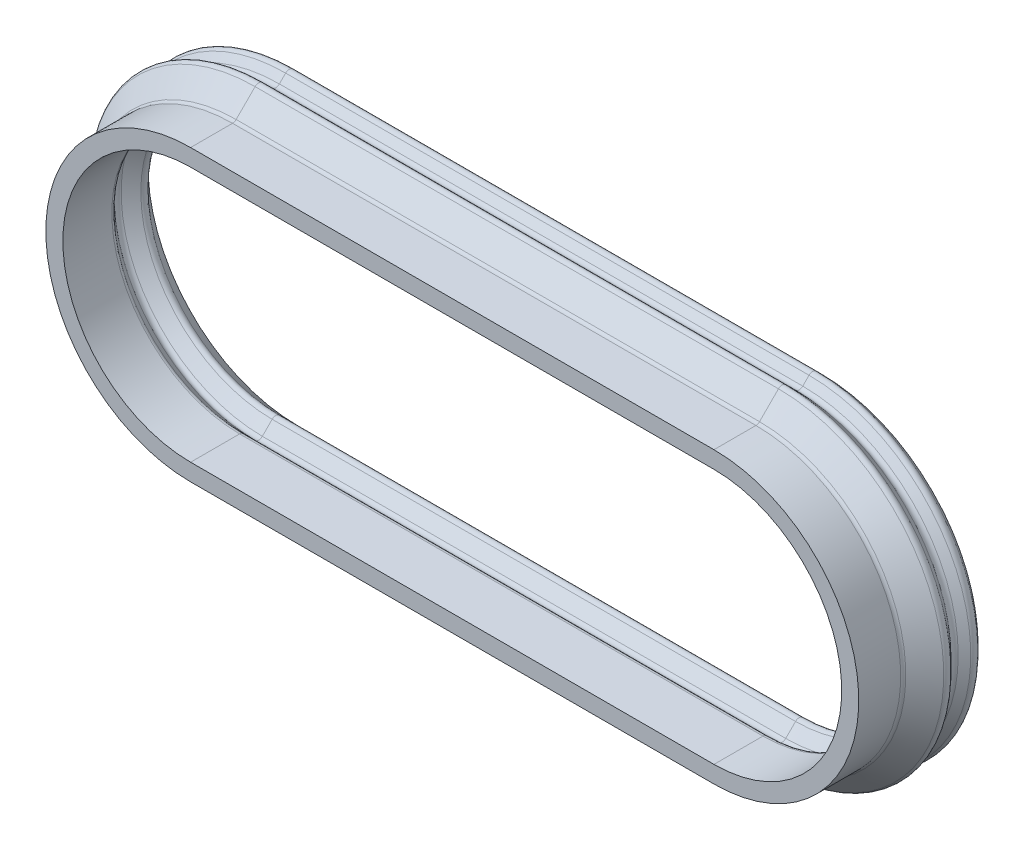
ISO-10303-21;
HEADER;
FILE_DESCRIPTION(('STEP AP214'),'2;1');
FILE_NAME('part.step','',(''),(''),'','','');
FILE_SCHEMA(('AUTOMOTIVE_DESIGN { 1 0 10303 214 1 1 1 1 }'));
ENDSEC;
DATA;
#1=APPLICATION_CONTEXT('core data for automotive mechanical design processes');
#2=APPLICATION_PROTOCOL_DEFINITION('international standard','automotive_design',2000,#1);
#3=PRODUCT_CONTEXT('',#1,'mechanical');
#4=PRODUCT('Part','Part','',(#3));
#5=PRODUCT_RELATED_PRODUCT_CATEGORY('part','',(#4));
#6=PRODUCT_DEFINITION_FORMATION('','',#4);
#7=PRODUCT_DEFINITION_CONTEXT('part definition',#1,'design');
#8=PRODUCT_DEFINITION('design','',#6,#7);
#9=PRODUCT_DEFINITION_SHAPE('','',#8);
#10=(LENGTH_UNIT() NAMED_UNIT(*) SI_UNIT(.MILLI.,.METRE.));
#11=(NAMED_UNIT(*) PLANE_ANGLE_UNIT() SI_UNIT($,.RADIAN.));
#12=(NAMED_UNIT(*) SI_UNIT($,.STERADIAN.) SOLID_ANGLE_UNIT());
#13=UNCERTAINTY_MEASURE_WITH_UNIT(LENGTH_MEASURE(1.E-05),#10,'distance_accuracy_value','');
#14=(GEOMETRIC_REPRESENTATION_CONTEXT(3) GLOBAL_UNCERTAINTY_ASSIGNED_CONTEXT((#13)) GLOBAL_UNIT_ASSIGNED_CONTEXT((#10,
#11,#12)) REPRESENTATION_CONTEXT('',''));
#15=CARTESIAN_POINT('',(0.,0.,0.));
#16=DIRECTION('',(0.,0.,1.));
#17=DIRECTION('',(1.,0.,0.));
#18=AXIS2_PLACEMENT_3D('',#15,#16,#17);
#19=CARTESIAN_POINT('',(3.9022,0.,0.));
#20=DIRECTION('',(0.,0.,1.));
#21=DIRECTION('',(1.,0.,0.));
#22=AXIS2_PLACEMENT_3D('',#19,#20,#21);
#23=CYLINDRICAL_SURFACE('',#22,2.159);
#24=DIRECTION('',(0.,0.,1.));
#25=VECTOR('',#24,1.);
#26=CARTESIAN_POINT('',(3.9022,-2.159,0.));
#27=LINE('',#26,#25);
#28=CARTESIAN_POINT('',(3.9022,-2.159,-0.625226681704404));
#29=VERTEX_POINT('',#28);
#30=CARTESIAN_POINT('',(3.9022,-2.159,0.));
#31=VERTEX_POINT('',#30);
#32=EDGE_CURVE('E565',#29,#31,#27,.T.);
#33=ORIENTED_EDGE('',*,*,#32,.F.);
#34=CARTESIAN_POINT('',(3.9022,0.,-0.625226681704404));
#35=DIRECTION('',(0.,0.,1.));
#36=DIRECTION('',(1.,0.,0.));
#37=AXIS2_PLACEMENT_3D('',#34,#35,#36);
#38=CIRCLE('',#37,2.159);
#39=CARTESIAN_POINT('',(3.90219999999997,2.159,-0.625226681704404));
#40=VERTEX_POINT('',#39);
#41=EDGE_CURVE('E11',#29,#40,#38,.T.);
#42=ORIENTED_EDGE('',*,*,#41,.T.);
#43=DIRECTION('',(0.,0.,1.));
#44=VECTOR('',#43,1.);
#45=CARTESIAN_POINT('',(3.90219999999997,2.159,0.));
#46=LINE('',#45,#44);
#47=CARTESIAN_POINT('',(3.90219999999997,2.159,0.));
#48=VERTEX_POINT('',#47);
#49=EDGE_CURVE('E547',#40,#48,#46,.T.);
#50=ORIENTED_EDGE('',*,*,#49,.T.);
#51=CARTESIAN_POINT('',(3.9022,0.,0.));
#52=DIRECTION('',(0.,0.,1.));
#53=DIRECTION('',(1.,0.,0.));
#54=AXIS2_PLACEMENT_3D('',#51,#52,#53);
#55=CIRCLE('',#54,2.159);
#56=EDGE_CURVE('E312',#31,#48,#55,.T.);
#57=ORIENTED_EDGE('',*,*,#56,.F.);
#58=EDGE_LOOP('',(#33,#42,#50,#57));
#59=FACE_BOUND('',#58,.T.);
#60=ADVANCED_FACE('F33',(#59),#23,.T.);
#61=CARTESIAN_POINT('',(3.9022,0.,-1.016));
#62=DIRECTION('',(0.,0.,-1.));
#63=DIRECTION('',(-1.,0.,0.));
#64=AXIS2_PLACEMENT_3D('',#61,#62,#63);
#65=CONICAL_SURFACE('',#64,2.51821024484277,0.785398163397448);
#66=DIRECTION('',(0.,0.707106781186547,0.707106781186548));
#67=VECTOR('',#66,1.);
#68=CARTESIAN_POINT('',(3.9022,-2.159,-0.656789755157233));
#69=LINE('',#68,#67);
#70=CARTESIAN_POINT('',(3.9022,-2.46432870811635,-0.962118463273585));
#71=VERTEX_POINT('',#70);
#72=CARTESIAN_POINT('',(3.9022,-2.18131846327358,-0.679108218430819));
#73=VERTEX_POINT('',#72);
#74=EDGE_CURVE('E595',#71,#73,#69,.T.);
#75=ORIENTED_EDGE('',*,*,#74,.F.);
#76=CARTESIAN_POINT('',(3.9022,0.,-0.962118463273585));
#77=DIRECTION('',(0.,0.,1.));
#78=DIRECTION('',(1.,0.,0.));
#79=AXIS2_PLACEMENT_3D('',#76,#77,#78);
#80=CIRCLE('',#79,2.46432870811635);
#81=CARTESIAN_POINT('',(3.90219999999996,2.46432870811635,-0.962118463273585));
#82=VERTEX_POINT('',#81);
#83=EDGE_CURVE('E330',#71,#82,#80,.T.);
#84=ORIENTED_EDGE('',*,*,#83,.T.);
#85=DIRECTION('',(0.,-0.707106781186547,0.707106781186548));
#86=VECTOR('',#85,1.);
#87=CARTESIAN_POINT('',(3.90219999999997,2.159,-0.656789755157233));
#88=LINE('',#87,#86);
#89=CARTESIAN_POINT('',(3.90219999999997,2.18131846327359,-0.679108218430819));
#90=VERTEX_POINT('',#89);
#91=EDGE_CURVE('E539',#82,#90,#88,.T.);
#92=ORIENTED_EDGE('',*,*,#91,.T.);
#93=CARTESIAN_POINT('',(3.9022,0.,-0.679108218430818));
#94=DIRECTION('',(0.,0.,-1.));
#95=DIRECTION('',(-1.,0.,0.));
#96=AXIS2_PLACEMENT_3D('',#93,#94,#95);
#97=CIRCLE('',#96,2.18131846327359);
#98=EDGE_CURVE('E328',#90,#73,#97,.T.);
#99=ORIENTED_EDGE('',*,*,#98,.T.);
#100=EDGE_LOOP('',(#75,#84,#92,#99));
#101=FACE_BOUND('',#100,.T.);
#102=ADVANCED_FACE('F544',(#101),#65,.T.);
#103=CARTESIAN_POINT('',(3.9022,0.,-1.27));
#104=DIRECTION('',(0.,0.,1.));
#105=DIRECTION('',(1.,0.,0.));
#106=AXIS2_PLACEMENT_3D('',#103,#104,#105);
#107=CONICAL_SURFACE('',#106,2.26421024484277,0.785398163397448);
#108=DIRECTION('',(0.,0.707106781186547,0.707106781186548));
#109=VECTOR('',#108,1.);
#110=CARTESIAN_POINT('',(3.90219999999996,2.51821024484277,-1.016));
#111=LINE('',#110,#109);
#112=CARTESIAN_POINT('',(3.90219999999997,2.31809178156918,-1.21611846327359));
#113=VERTEX_POINT('',#112);
#114=CARTESIAN_POINT('',(3.90219999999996,2.46432870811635,-1.06988153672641));
#115=VERTEX_POINT('',#114);
#116=EDGE_CURVE('E548',#113,#115,#111,.T.);
#117=ORIENTED_EDGE('',*,*,#116,.T.);
#118=CARTESIAN_POINT('',(3.9022,0.,-1.06988153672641));
#119=DIRECTION('',(0.,0.,-1.));
#120=DIRECTION('',(-1.,0.,0.));
#121=AXIS2_PLACEMENT_3D('',#118,#119,#120);
#122=CIRCLE('',#121,2.46432870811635);
#123=CARTESIAN_POINT('',(3.9022,-2.46432870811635,-1.06988153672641));
#124=VERTEX_POINT('',#123);
#125=EDGE_CURVE('E334',#115,#124,#122,.T.);
#126=ORIENTED_EDGE('',*,*,#125,.T.);
#127=DIRECTION('',(0.,-0.707106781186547,0.707106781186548));
#128=VECTOR('',#127,1.);
#129=CARTESIAN_POINT('',(3.9022,-2.51821024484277,-1.016));
#130=LINE('',#129,#128);
#131=CARTESIAN_POINT('',(3.9022,-2.31809178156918,-1.21611846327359));
#132=VERTEX_POINT('',#131);
#133=EDGE_CURVE('E592',#132,#124,#130,.T.);
#134=ORIENTED_EDGE('',*,*,#133,.F.);
#135=CARTESIAN_POINT('',(3.9022,0.,-1.21611846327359));
#136=DIRECTION('',(0.,0.,1.));
#137=DIRECTION('',(1.,0.,0.));
#138=AXIS2_PLACEMENT_3D('',#135,#136,#137);
#139=CIRCLE('',#138,2.31809178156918);
#140=EDGE_CURVE('E332',#132,#113,#139,.T.);
#141=ORIENTED_EDGE('',*,*,#140,.T.);
#142=EDGE_LOOP('',(#117,#126,#134,#141));
#143=FACE_BOUND('',#142,.T.);
#144=ADVANCED_FACE('F692',(#143),#107,.T.);
#145=CARTESIAN_POINT('',(3.9022,0.,-1.47139487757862));
#146=DIRECTION('',(0.,0.,-1.));
#147=DIRECTION('',(-1.,0.,0.));
#148=AXIS2_PLACEMENT_3D('',#145,#146,#147);
#149=CONICAL_SURFACE('',#148,2.46560512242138,0.785398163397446);
#150=DIRECTION('',(0.,0.707106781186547,0.707106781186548));
#151=VECTOR('',#150,1.);
#152=CARTESIAN_POINT('',(3.9022,-2.26421024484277,-1.27));
#153=LINE('',#152,#151);
#154=CARTESIAN_POINT('',(3.9022,-2.41172358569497,-1.4175133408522));
#155=VERTEX_POINT('',#154);
#156=CARTESIAN_POINT('',(3.9022,-2.31809178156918,-1.32388153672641));
#157=VERTEX_POINT('',#156);
#158=EDGE_CURVE('E589',#155,#157,#153,.T.);
#159=ORIENTED_EDGE('',*,*,#158,.F.);
#160=CARTESIAN_POINT('',(3.9022,0.,-1.4175133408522));
#161=DIRECTION('',(0.,0.,1.));
#162=DIRECTION('',(1.,0.,0.));
#163=AXIS2_PLACEMENT_3D('',#160,#161,#162);
#164=CIRCLE('',#163,2.41172358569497);
#165=CARTESIAN_POINT('',(3.90219999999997,2.41172358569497,-1.4175133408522));
#166=VERTEX_POINT('',#165);
#167=EDGE_CURVE('E42',#155,#166,#164,.T.);
#168=ORIENTED_EDGE('',*,*,#167,.T.);
#169=DIRECTION('',(0.,-0.707106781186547,0.707106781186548));
#170=VECTOR('',#169,1.);
#171=CARTESIAN_POINT('',(3.90219999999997,2.26421024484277,-1.27));
#172=LINE('',#171,#170);
#173=CARTESIAN_POINT('',(3.90219999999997,2.31809178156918,-1.32388153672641));
#174=VERTEX_POINT('',#173);
#175=EDGE_CURVE('E553',#166,#174,#172,.T.);
#176=ORIENTED_EDGE('',*,*,#175,.T.);
#177=CARTESIAN_POINT('',(3.9022,0.,-1.32388153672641));
#178=DIRECTION('',(0.,0.,-1.));
#179=DIRECTION('',(-1.,0.,0.));
#180=AXIS2_PLACEMENT_3D('',#177,#178,#179);
#181=CIRCLE('',#180,2.31809178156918);
#182=EDGE_CURVE('E445',#174,#157,#181,.T.);
#183=ORIENTED_EDGE('',*,*,#182,.T.);
#184=EDGE_LOOP('',(#159,#168,#176,#183));
#185=FACE_BOUND('',#184,.T.);
#186=ADVANCED_FACE('F617',(#185),#149,.T.);
#187=CARTESIAN_POINT('',(3.9022,0.,-1.651));
#188=DIRECTION('',(0.,0.,1.));
#189=DIRECTION('',(1.,0.,0.));
#190=AXIS2_PLACEMENT_3D('',#187,#188,#189);
#191=CONICAL_SURFACE('',#190,2.286,0.785398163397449);
#192=DIRECTION('',(0.,-0.707106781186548,0.707106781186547));
#193=VECTOR('',#192,1.);
#194=CARTESIAN_POINT('',(3.9022,-2.46560512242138,-1.47139487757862));
#195=LINE('',#194,#193);
#196=CARTESIAN_POINT('',(3.9022,-2.33988153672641,-1.59711846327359));
#197=VERTEX_POINT('',#196);
#198=CARTESIAN_POINT('',(3.9022,-2.41172358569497,-1.52527641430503));
#199=VERTEX_POINT('',#198);
#200=EDGE_CURVE('E586',#197,#199,#195,.T.);
#201=ORIENTED_EDGE('',*,*,#200,.F.);
#202=CARTESIAN_POINT('',(3.9022,0.,-1.59711846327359));
#203=DIRECTION('',(0.,0.,-1.));
#204=DIRECTION('',(-1.,0.,0.));
#205=AXIS2_PLACEMENT_3D('',#202,#203,#204);
#206=CIRCLE('',#205,2.33988153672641);
#207=CARTESIAN_POINT('',(3.90219999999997,2.33988153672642,-1.59711846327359));
#208=VERTEX_POINT('',#207);
#209=EDGE_CURVE('E443',#197,#208,#206,.F.);
#210=ORIENTED_EDGE('',*,*,#209,.T.);
#211=DIRECTION('',(0.,0.707106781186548,0.707106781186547));
#212=VECTOR('',#211,1.);
#213=CARTESIAN_POINT('',(3.90219999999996,2.46560512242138,-1.47139487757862));
#214=LINE('',#213,#212);
#215=CARTESIAN_POINT('',(3.90219999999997,2.41172358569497,-1.52527641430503));
#216=VERTEX_POINT('',#215);
#217=EDGE_CURVE('E610',#208,#216,#214,.T.);
#218=ORIENTED_EDGE('',*,*,#217,.T.);
#219=CARTESIAN_POINT('',(3.9022,0.,-1.52527641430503));
#220=DIRECTION('',(0.,0.,-1.));
#221=DIRECTION('',(-1.,0.,0.));
#222=AXIS2_PLACEMENT_3D('',#219,#220,#221);
#223=CIRCLE('',#222,2.41172358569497);
#224=EDGE_CURVE('E441',#216,#199,#223,.T.);
#225=ORIENTED_EDGE('',*,*,#224,.T.);
#226=EDGE_LOOP('',(#201,#210,#218,#225));
#227=FACE_BOUND('',#226,.T.);
#228=ADVANCED_FACE('F1154',(#227),#191,.T.);
#229=CARTESIAN_POINT('',(3.9022,0.,-1.27));
#230=DIRECTION('',(0.,0.,-1.));
#231=DIRECTION('',(-1.,0.,0.));
#232=AXIS2_PLACEMENT_3D('',#229,#230,#231);
#233=CONICAL_SURFACE('',#232,1.905,0.785398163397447);
#234=DIRECTION('',(0.,-0.707106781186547,-0.707106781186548));
#235=VECTOR('',#234,1.);
#236=CARTESIAN_POINT('',(3.9022,-1.905,-1.27));
#237=LINE('',#236,#235);
#238=CARTESIAN_POINT('',(3.9022,-1.95888153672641,-1.32388153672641));
#239=VERTEX_POINT('',#238);
#240=CARTESIAN_POINT('',(3.9022,-2.23211846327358,-1.59711846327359));
#241=VERTEX_POINT('',#240);
#242=EDGE_CURVE('E583',#239,#241,#237,.T.);
#243=ORIENTED_EDGE('',*,*,#242,.F.);
#244=CARTESIAN_POINT('',(3.9022,0.,-1.32388153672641));
#245=DIRECTION('',(0.,0.,1.));
#246=DIRECTION('',(1.,0.,0.));
#247=AXIS2_PLACEMENT_3D('',#244,#245,#246);
#248=CIRCLE('',#247,1.95888153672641);
#249=CARTESIAN_POINT('',(3.90219999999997,1.95888153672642,-1.32388153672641));
#250=VERTEX_POINT('',#249);
#251=EDGE_CURVE('E377',#239,#250,#248,.T.);
#252=ORIENTED_EDGE('',*,*,#251,.T.);
#253=DIRECTION('',(0.,0.707106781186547,-0.707106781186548));
#254=VECTOR('',#253,1.);
#255=CARTESIAN_POINT('',(3.90219999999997,1.905,-1.27));
#256=LINE('',#255,#254);
#257=CARTESIAN_POINT('',(3.90219999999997,2.23211846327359,-1.59711846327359));
#258=VERTEX_POINT('',#257);
#259=EDGE_CURVE('E607',#250,#258,#256,.T.);
#260=ORIENTED_EDGE('',*,*,#259,.T.);
#261=CARTESIAN_POINT('',(3.9022,0.,-1.59711846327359));
#262=DIRECTION('',(0.,0.,1.));
#263=DIRECTION('',(1.,0.,0.));
#264=AXIS2_PLACEMENT_3D('',#261,#262,#263);
#265=CIRCLE('',#264,2.23211846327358);
#266=EDGE_CURVE('E375',#258,#241,#265,.F.);
#267=ORIENTED_EDGE('',*,*,#266,.T.);
#268=EDGE_LOOP('',(#243,#252,#260,#267));
#269=FACE_BOUND('',#268,.T.);
#270=ADVANCED_FACE('F1144',(#269),#233,.F.);
#271=CARTESIAN_POINT('',(3.9022,0.,-1.016));
#272=DIRECTION('',(0.,0.,1.));
#273=DIRECTION('',(1.,0.,0.));
#274=AXIS2_PLACEMENT_3D('',#271,#272,#273);
#275=CONICAL_SURFACE('',#274,2.159,0.785398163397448);
#276=DIRECTION('',(0.,0.707106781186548,-0.707106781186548));
#277=VECTOR('',#276,1.);
#278=CARTESIAN_POINT('',(3.9022,-2.159,-1.016));
#279=LINE('',#278,#277);
#280=CARTESIAN_POINT('',(3.9022,-2.10511846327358,-1.06988153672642));
#281=VERTEX_POINT('',#280);
#282=CARTESIAN_POINT('',(3.9022,-1.95888153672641,-1.21611846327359));
#283=VERTEX_POINT('',#282);
#284=EDGE_CURVE('E580',#281,#283,#279,.T.);
#285=ORIENTED_EDGE('',*,*,#284,.F.);
#286=CARTESIAN_POINT('',(3.9022,0.,-1.06988153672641));
#287=DIRECTION('',(0.,0.,1.));
#288=DIRECTION('',(1.,0.,0.));
#289=AXIS2_PLACEMENT_3D('',#286,#287,#288);
#290=CIRCLE('',#289,2.10511846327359);
#291=CARTESIAN_POINT('',(3.90219999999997,2.10511846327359,-1.06988153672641));
#292=VERTEX_POINT('',#291);
#293=EDGE_CURVE('E364',#281,#292,#290,.T.);
#294=ORIENTED_EDGE('',*,*,#293,.T.);
#295=DIRECTION('',(0.,-0.707106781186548,-0.707106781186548));
#296=VECTOR('',#295,1.);
#297=CARTESIAN_POINT('',(3.90219999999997,2.159,-1.016));
#298=LINE('',#297,#296);
#299=CARTESIAN_POINT('',(3.90219999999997,1.95888153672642,-1.21611846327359));
#300=VERTEX_POINT('',#299);
#301=EDGE_CURVE('E604',#292,#300,#298,.T.);
#302=ORIENTED_EDGE('',*,*,#301,.T.);
#303=CARTESIAN_POINT('',(3.9022,0.,-1.21611846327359));
#304=DIRECTION('',(0.,0.,-1.));
#305=DIRECTION('',(-1.,0.,0.));
#306=AXIS2_PLACEMENT_3D('',#303,#304,#305);
#307=CIRCLE('',#306,1.95888153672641);
#308=EDGE_CURVE('E362',#300,#283,#307,.T.);
#309=ORIENTED_EDGE('',*,*,#308,.T.);
#310=EDGE_LOOP('',(#285,#294,#302,#309));
#311=FACE_BOUND('',#310,.T.);
#312=ADVANCED_FACE('F1134',(#311),#275,.F.);
#313=CARTESIAN_POINT('',(3.9022,0.,-0.762));
#314=DIRECTION('',(0.,0.,-1.));
#315=DIRECTION('',(-1.,0.,0.));
#316=AXIS2_PLACEMENT_3D('',#313,#314,#315);
#317=CONICAL_SURFACE('',#316,1.905,0.785398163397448);
#318=DIRECTION('',(0.,-0.707106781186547,-0.707106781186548));
#319=VECTOR('',#318,1.);
#320=CARTESIAN_POINT('',(3.9022,-1.905,-0.762));
#321=LINE('',#320,#319);
#322=CARTESIAN_POINT('',(3.9022,-1.92731846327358,-0.784318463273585));
#323=VERTEX_POINT('',#322);
#324=CARTESIAN_POINT('',(3.9022,-2.10511846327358,-0.962118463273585));
#325=VERTEX_POINT('',#324);
#326=EDGE_CURVE('E574',#323,#325,#321,.T.);
#327=ORIENTED_EDGE('',*,*,#326,.F.);
#328=CARTESIAN_POINT('',(3.9022,0.,-0.784318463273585));
#329=DIRECTION('',(0.,0.,1.));
#330=DIRECTION('',(1.,0.,0.));
#331=AXIS2_PLACEMENT_3D('',#328,#329,#330);
#332=CIRCLE('',#331,1.92731846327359);
#333=CARTESIAN_POINT('',(3.90219999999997,1.92731846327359,-0.784318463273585));
#334=VERTEX_POINT('',#333);
#335=EDGE_CURVE('E346',#323,#334,#332,.T.);
#336=ORIENTED_EDGE('',*,*,#335,.T.);
#337=DIRECTION('',(0.,0.707106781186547,-0.707106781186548));
#338=VECTOR('',#337,1.);
#339=CARTESIAN_POINT('',(3.90219999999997,1.905,-0.762));
#340=LINE('',#339,#338);
#341=CARTESIAN_POINT('',(3.90219999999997,2.10511846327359,-0.962118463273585));
#342=VERTEX_POINT('',#341);
#343=EDGE_CURVE('E601',#334,#342,#340,.T.);
#344=ORIENTED_EDGE('',*,*,#343,.T.);
#345=CARTESIAN_POINT('',(3.9022,0.,-0.962118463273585));
#346=DIRECTION('',(0.,0.,-1.));
#347=DIRECTION('',(-1.,0.,0.));
#348=AXIS2_PLACEMENT_3D('',#345,#346,#347);
#349=CIRCLE('',#348,2.10511846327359);
#350=EDGE_CURVE('E344',#342,#325,#349,.T.);
#351=ORIENTED_EDGE('',*,*,#350,.T.);
#352=EDGE_LOOP('',(#327,#336,#344,#351));
#353=FACE_BOUND('',#352,.T.);
#354=ADVANCED_FACE('F684',(#353),#317,.F.);
#355=CARTESIAN_POINT('',(3.9022,0.,0.));
#356=DIRECTION('',(0.,0.,1.));
#357=DIRECTION('',(1.,0.,0.));
#358=AXIS2_PLACEMENT_3D('',#355,#356,#357);
#359=CYLINDRICAL_SURFACE('',#358,1.905);
#360=DIRECTION('',(0.,0.,-1.));
#361=VECTOR('',#360,1.);
#362=CARTESIAN_POINT('',(3.90219999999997,1.905,0.));
#363=LINE('',#362,#361);
#364=CARTESIAN_POINT('',(3.90219999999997,1.905,0.));
#365=VERTEX_POINT('',#364);
#366=CARTESIAN_POINT('',(3.90219999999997,1.905,-0.73043692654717));
#367=VERTEX_POINT('',#366);
#368=EDGE_CURVE('E294',#365,#367,#363,.T.);
#369=ORIENTED_EDGE('',*,*,#368,.T.);
#370=CARTESIAN_POINT('',(3.9022,0.,-0.730436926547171));
#371=DIRECTION('',(0.,0.,-1.));
#372=DIRECTION('',(-1.,0.,0.));
#373=AXIS2_PLACEMENT_3D('',#370,#371,#372);
#374=CIRCLE('',#373,1.905);
#375=CARTESIAN_POINT('',(3.9022,-1.905,-0.73043692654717));
#376=VERTEX_POINT('',#375);
#377=EDGE_CURVE('E348',#367,#376,#374,.T.);
#378=ORIENTED_EDGE('',*,*,#377,.T.);
#379=DIRECTION('',(0.,0.,-1.));
#380=VECTOR('',#379,1.);
#381=CARTESIAN_POINT('',(3.9022,-1.905,0.));
#382=LINE('',#381,#380);
#383=CARTESIAN_POINT('',(3.9022,-1.905,0.));
#384=VERTEX_POINT('',#383);
#385=EDGE_CURVE('E571',#384,#376,#382,.T.);
#386=ORIENTED_EDGE('',*,*,#385,.F.);
#387=CARTESIAN_POINT('',(3.9022,0.,0.));
#388=DIRECTION('',(0.,0.,1.));
#389=DIRECTION('',(1.,0.,0.));
#390=AXIS2_PLACEMENT_3D('',#387,#388,#389);
#391=CIRCLE('',#390,1.905);
#392=EDGE_CURVE('E550',#384,#365,#391,.T.);
#393=ORIENTED_EDGE('',*,*,#392,.T.);
#394=EDGE_LOOP('',(#369,#378,#386,#393));
#395=FACE_BOUND('',#394,.T.);
#396=ADVANCED_FACE('F676',(#395),#359,.F.);
#397=CARTESIAN_POINT('',(-3.9022,-2.159,0.));
#398=DIRECTION('',(0.,1.,0.));
#399=DIRECTION('',(-1.,0.,0.));
#400=AXIS2_PLACEMENT_3D('',#397,#398,#399);
#401=PLANE('',#400);
#402=DIRECTION('',(0.,0.,1.));
#403=VECTOR('',#402,1.);
#404=CARTESIAN_POINT('',(-3.9022,-2.159,0.));
#405=LINE('',#404,#403);
#406=CARTESIAN_POINT('',(-3.9022,-2.159,-0.625226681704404));
#407=VERTEX_POINT('',#406);
#408=CARTESIAN_POINT('',(-3.9022,-2.159,0.));
#409=VERTEX_POINT('',#408);
#410=EDGE_CURVE('E279',#407,#409,#405,.T.);
#411=ORIENTED_EDGE('',*,*,#410,.F.);
#412=DIRECTION('',(1.,0.,0.));
#413=VECTOR('',#412,1.);
#414=CARTESIAN_POINT('',(3.9022,-2.159,-0.625226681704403));
#415=LINE('',#414,#413);
#416=EDGE_CURVE('E421',#407,#29,#415,.T.);
#417=ORIENTED_EDGE('',*,*,#416,.T.);
#418=ORIENTED_EDGE('',*,*,#32,.T.);
#419=DIRECTION('',(1.,0.,0.));
#420=VECTOR('',#419,1.);
#421=CARTESIAN_POINT('',(-3.9022,-2.159,0.));
#422=LINE('',#421,#420);
#423=EDGE_CURVE('E564',#409,#31,#422,.T.);
#424=ORIENTED_EDGE('',*,*,#423,.F.);
#425=EDGE_LOOP('',(#411,#417,#418,#424));
#426=FACE_BOUND('',#425,.T.);
#427=ADVANCED_FACE('F674',(#426),#401,.F.);
#428=CARTESIAN_POINT('',(-3.9022,-2.159,-0.656789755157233));
#429=DIRECTION('',(0.,0.707106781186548,-0.707106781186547));
#430=DIRECTION('',(0.,0.707106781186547,0.707106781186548));
#431=AXIS2_PLACEMENT_3D('',#428,#429,#430);
#432=PLANE('',#431);
#433=ORIENTED_EDGE('',*,*,#74,.T.);
#434=DIRECTION('',(1.,0.,0.));
#435=VECTOR('',#434,1.);
#436=CARTESIAN_POINT('',(-3.9022,-2.18131846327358,-0.679108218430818));
#437=LINE('',#436,#435);
#438=CARTESIAN_POINT('',(-3.9022,-2.18131846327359,-0.679108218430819));
#439=VERTEX_POINT('',#438);
#440=EDGE_CURVE('E426',#73,#439,#437,.F.);
#441=ORIENTED_EDGE('',*,*,#440,.T.);
#442=DIRECTION('',(0.,0.707106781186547,0.707106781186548));
#443=VECTOR('',#442,1.);
#444=CARTESIAN_POINT('',(-3.9022,-2.159,-0.656789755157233));
#445=LINE('',#444,#443);
#446=CARTESIAN_POINT('',(-3.9022,-2.46432870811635,-0.962118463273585));
#447=VERTEX_POINT('',#446);
#448=EDGE_CURVE('E652',#447,#439,#445,.T.);
#449=ORIENTED_EDGE('',*,*,#448,.F.);
#450=DIRECTION('',(1.,0.,0.));
#451=VECTOR('',#450,1.);
#452=CARTESIAN_POINT('',(-3.9022,-2.46432870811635,-0.962118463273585));
#453=LINE('',#452,#451);
#454=EDGE_CURVE('E424',#447,#71,#453,.T.);
#455=ORIENTED_EDGE('',*,*,#454,.T.);
#456=EDGE_LOOP('',(#433,#441,#449,#455));
#457=FACE_BOUND('',#456,.T.);
#458=ADVANCED_FACE('F665',(#457),#432,.F.);
#459=CARTESIAN_POINT('',(-3.9022,-2.51821024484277,-1.016));
#460=DIRECTION('',(0.,0.707106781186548,0.707106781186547));
#461=DIRECTION('',(0.,-0.707106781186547,0.707106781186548));
#462=AXIS2_PLACEMENT_3D('',#459,#460,#461);
#463=PLANE('',#462);
#464=DIRECTION('',(0.,-0.707106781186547,0.707106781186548));
#465=VECTOR('',#464,1.);
#466=CARTESIAN_POINT('',(-3.9022,-2.51821024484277,-1.016));
#467=LINE('',#466,#465);
#468=CARTESIAN_POINT('',(-3.9022,-2.31809178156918,-1.21611846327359));
#469=VERTEX_POINT('',#468);
#470=CARTESIAN_POINT('',(-3.9022,-2.46432870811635,-1.06988153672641));
#471=VERTEX_POINT('',#470);
#472=EDGE_CURVE('E648',#469,#471,#467,.T.);
#473=ORIENTED_EDGE('',*,*,#472,.F.);
#474=DIRECTION('',(1.,0.,0.));
#475=VECTOR('',#474,1.);
#476=CARTESIAN_POINT('',(3.9022,-2.31809178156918,-1.21611846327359));
#477=LINE('',#476,#475);
#478=EDGE_CURVE('E418',#469,#132,#477,.T.);
#479=ORIENTED_EDGE('',*,*,#478,.T.);
#480=ORIENTED_EDGE('',*,*,#133,.T.);
#481=DIRECTION('',(1.,0.,0.));
#482=VECTOR('',#481,1.);
#483=CARTESIAN_POINT('',(-3.9022,-2.46432870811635,-1.06988153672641));
#484=LINE('',#483,#482);
#485=EDGE_CURVE('E416',#124,#471,#484,.F.);
#486=ORIENTED_EDGE('',*,*,#485,.T.);
#487=EDGE_LOOP('',(#473,#479,#480,#486));
#488=FACE_BOUND('',#487,.T.);
#489=ADVANCED_FACE('F682',(#488),#463,.F.);
#490=CARTESIAN_POINT('',(-3.9022,-2.26421024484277,-1.27));
#491=DIRECTION('',(0.,0.707106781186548,-0.707106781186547));
#492=DIRECTION('',(0.,0.707106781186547,0.707106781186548));
#493=AXIS2_PLACEMENT_3D('',#490,#491,#492);
#494=PLANE('',#493);
#495=DIRECTION('',(0.,0.707106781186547,0.707106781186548));
#496=VECTOR('',#495,1.);
#497=CARTESIAN_POINT('',(-3.9022,-2.26421024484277,-1.27));
#498=LINE('',#497,#496);
#499=CARTESIAN_POINT('',(-3.9022,-2.41172358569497,-1.4175133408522));
#500=VERTEX_POINT('',#499);
#501=CARTESIAN_POINT('',(-3.9022,-2.31809178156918,-1.32388153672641));
#502=VERTEX_POINT('',#501);
#503=EDGE_CURVE('E641',#500,#502,#498,.T.);
#504=ORIENTED_EDGE('',*,*,#503,.F.);
#505=DIRECTION('',(1.,0.,0.));
#506=VECTOR('',#505,1.);
#507=CARTESIAN_POINT('',(-3.9022,-2.41172358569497,-1.4175133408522));
#508=LINE('',#507,#506);
#509=EDGE_CURVE('E405',#500,#155,#508,.T.);
#510=ORIENTED_EDGE('',*,*,#509,.T.);
#511=ORIENTED_EDGE('',*,*,#158,.T.);
#512=DIRECTION('',(1.,0.,0.));
#513=VECTOR('',#512,1.);
#514=CARTESIAN_POINT('',(-3.9022,-2.31809178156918,-1.32388153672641));
#515=LINE('',#514,#513);
#516=EDGE_CURVE('E402',#157,#502,#515,.F.);
#517=ORIENTED_EDGE('',*,*,#516,.T.);
#518=EDGE_LOOP('',(#504,#510,#511,#517));
#519=FACE_BOUND('',#518,.T.);
#520=ADVANCED_FACE('F640',(#519),#494,.F.);
#521=CARTESIAN_POINT('',(-3.9022,-2.46560512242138,-1.47139487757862));
#522=DIRECTION('',(0.,0.707106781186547,0.707106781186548));
#523=DIRECTION('',(0.,-0.707106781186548,0.707106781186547));
#524=AXIS2_PLACEMENT_3D('',#521,#522,#523);
#525=PLANE('',#524);
#526=DIRECTION('',(0.,-0.707106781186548,0.707106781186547));
#527=VECTOR('',#526,1.);
#528=CARTESIAN_POINT('',(-3.9022,-2.46560512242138,-1.47139487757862));
#529=LINE('',#528,#527);
#530=CARTESIAN_POINT('',(-3.9022,-2.33988153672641,-1.59711846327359));
#531=VERTEX_POINT('',#530);
#532=CARTESIAN_POINT('',(-3.9022,-2.41172358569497,-1.52527641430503));
#533=VERTEX_POINT('',#532);
#534=EDGE_CURVE('E649',#531,#533,#529,.T.);
#535=ORIENTED_EDGE('',*,*,#534,.F.);
#536=DIRECTION('',(1.,0.,0.));
#537=VECTOR('',#536,1.);
#538=CARTESIAN_POINT('',(-3.9022,-2.33988153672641,-1.59711846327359));
#539=LINE('',#538,#537);
#540=EDGE_CURVE('E387',#531,#197,#539,.T.);
#541=ORIENTED_EDGE('',*,*,#540,.T.);
#542=ORIENTED_EDGE('',*,*,#200,.T.);
#543=DIRECTION('',(1.,0.,0.));
#544=VECTOR('',#543,1.);
#545=CARTESIAN_POINT('',(-3.9022,-2.41172358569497,-1.52527641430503));
#546=LINE('',#545,#544);
#547=EDGE_CURVE('E384',#199,#533,#546,.F.);
#548=ORIENTED_EDGE('',*,*,#547,.T.);
#549=EDGE_LOOP('',(#535,#541,#542,#548));
#550=FACE_BOUND('',#549,.T.);
#551=ADVANCED_FACE('F1089',(#550),#525,.F.);
#552=CARTESIAN_POINT('',(-3.9022,-1.905,-1.27));
#553=DIRECTION('',(0.,-0.707106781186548,0.707106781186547));
#554=DIRECTION('',(0.,-0.707106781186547,-0.707106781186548));
#555=AXIS2_PLACEMENT_3D('',#552,#553,#554);
#556=PLANE('',#555);
#557=DIRECTION('',(0.,-0.707106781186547,-0.707106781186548));
#558=VECTOR('',#557,1.);
#559=CARTESIAN_POINT('',(-3.9022,-1.905,-1.27));
#560=LINE('',#559,#558);
#561=CARTESIAN_POINT('',(-3.9022,-1.95888153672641,-1.32388153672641));
#562=VERTEX_POINT('',#561);
#563=CARTESIAN_POINT('',(-3.9022,-2.23211846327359,-1.59711846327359));
#564=VERTEX_POINT('',#563);
#565=EDGE_CURVE('E655',#562,#564,#560,.T.);
#566=ORIENTED_EDGE('',*,*,#565,.F.);
#567=DIRECTION('',(1.,0.,0.));
#568=VECTOR('',#567,1.);
#569=CARTESIAN_POINT('',(-3.9022,-1.95888153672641,-1.32388153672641));
#570=LINE('',#569,#568);
#571=EDGE_CURVE('E382',#562,#239,#570,.T.);
#572=ORIENTED_EDGE('',*,*,#571,.T.);
#573=ORIENTED_EDGE('',*,*,#242,.T.);
#574=DIRECTION('',(1.,0.,0.));
#575=VECTOR('',#574,1.);
#576=CARTESIAN_POINT('',(-3.9022,-2.23211846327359,-1.59711846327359));
#577=LINE('',#576,#575);
#578=EDGE_CURVE('E379',#241,#564,#577,.F.);
#579=ORIENTED_EDGE('',*,*,#578,.T.);
#580=EDGE_LOOP('',(#566,#572,#573,#579));
#581=FACE_BOUND('',#580,.T.);
#582=ADVANCED_FACE('F1081',(#581),#556,.F.);
#583=CARTESIAN_POINT('',(-3.9022,-2.159,-1.016));
#584=DIRECTION('',(0.,-0.707106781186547,-0.707106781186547));
#585=DIRECTION('',(0.,0.707106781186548,-0.707106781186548));
#586=AXIS2_PLACEMENT_3D('',#583,#584,#585);
#587=PLANE('',#586);
#588=DIRECTION('',(0.,0.707106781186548,-0.707106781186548));
#589=VECTOR('',#588,1.);
#590=CARTESIAN_POINT('',(-3.9022,-2.159,-1.016));
#591=LINE('',#590,#589);
#592=CARTESIAN_POINT('',(-3.9022,-2.10511846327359,-1.06988153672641));
#593=VERTEX_POINT('',#592);
#594=CARTESIAN_POINT('',(-3.9022,-1.95888153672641,-1.21611846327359));
#595=VERTEX_POINT('',#594);
#596=EDGE_CURVE('E1213',#593,#595,#591,.T.);
#597=ORIENTED_EDGE('',*,*,#596,.F.);
#598=DIRECTION('',(1.,0.,0.));
#599=VECTOR('',#598,1.);
#600=CARTESIAN_POINT('',(3.9022,-2.10511846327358,-1.06988153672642));
#601=LINE('',#600,#599);
#602=EDGE_CURVE('E368',#593,#281,#601,.T.);
#603=ORIENTED_EDGE('',*,*,#602,.T.);
#604=ORIENTED_EDGE('',*,*,#284,.T.);
#605=DIRECTION('',(1.,0.,0.));
#606=VECTOR('',#605,1.);
#607=CARTESIAN_POINT('',(-3.9022,-1.95888153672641,-1.21611846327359));
#608=LINE('',#607,#606);
#609=EDGE_CURVE('E366',#283,#595,#608,.F.);
#610=ORIENTED_EDGE('',*,*,#609,.T.);
#611=EDGE_LOOP('',(#597,#603,#604,#610));
#612=FACE_BOUND('',#611,.T.);
#613=ADVANCED_FACE('F1073',(#612),#587,.F.);
#614=CARTESIAN_POINT('',(-3.9022,-1.905,-0.762));
#615=DIRECTION('',(0.,-0.707106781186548,0.707106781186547));
#616=DIRECTION('',(0.,-0.707106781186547,-0.707106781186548));
#617=AXIS2_PLACEMENT_3D('',#614,#615,#616);
#618=PLANE('',#617);
#619=DIRECTION('',(0.,-0.707106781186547,-0.707106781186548));
#620=VECTOR('',#619,1.);
#621=CARTESIAN_POINT('',(-3.9022,-1.905,-0.762));
#622=LINE('',#621,#620);
#623=CARTESIAN_POINT('',(-3.9022,-1.92731846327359,-0.784318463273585));
#624=VERTEX_POINT('',#623);
#625=CARTESIAN_POINT('',(-3.9022,-2.10511846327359,-0.962118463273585));
#626=VERTEX_POINT('',#625);
#627=EDGE_CURVE('E1210',#624,#626,#622,.T.);
#628=ORIENTED_EDGE('',*,*,#627,.F.);
#629=DIRECTION('',(1.,0.,0.));
#630=VECTOR('',#629,1.);
#631=CARTESIAN_POINT('',(-3.9022,-1.92731846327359,-0.784318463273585));
#632=LINE('',#631,#630);
#633=EDGE_CURVE('E352',#624,#323,#632,.T.);
#634=ORIENTED_EDGE('',*,*,#633,.T.);
#635=ORIENTED_EDGE('',*,*,#326,.T.);
#636=DIRECTION('',(1.,0.,0.));
#637=VECTOR('',#636,1.);
#638=CARTESIAN_POINT('',(-3.9022,-2.10511846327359,-0.962118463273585));
#639=LINE('',#638,#637);
#640=EDGE_CURVE('E350',#325,#626,#639,.F.);
#641=ORIENTED_EDGE('',*,*,#640,.T.);
#642=EDGE_LOOP('',(#628,#634,#635,#641));
#643=FACE_BOUND('',#642,.T.);
#644=ADVANCED_FACE('F1065',(#643),#618,.F.);
#645=CARTESIAN_POINT('',(-3.9022,-1.905,0.));
#646=DIRECTION('',(0.,-1.,0.));
#647=DIRECTION('',(1.,0.,0.));
#648=AXIS2_PLACEMENT_3D('',#645,#646,#647);
#649=PLANE('',#648);
#650=ORIENTED_EDGE('',*,*,#385,.T.);
#651=DIRECTION('',(1.,0.,0.));
#652=VECTOR('',#651,1.);
#653=CARTESIAN_POINT('',(-3.9022,-1.905,-0.73043692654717));
#654=LINE('',#653,#652);
#655=CARTESIAN_POINT('',(-3.9022,-1.905,-0.73043692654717));
#656=VERTEX_POINT('',#655);
#657=EDGE_CURVE('E354',#376,#656,#654,.F.);
#658=ORIENTED_EDGE('',*,*,#657,.T.);
#659=DIRECTION('',(0.,0.,-1.));
#660=VECTOR('',#659,1.);
#661=CARTESIAN_POINT('',(-3.9022,-1.905,0.));
#662=LINE('',#661,#660);
#663=CARTESIAN_POINT('',(-3.9022,-1.905,0.));
#664=VERTEX_POINT('',#663);
#665=EDGE_CURVE('E300',#664,#656,#662,.T.);
#666=ORIENTED_EDGE('',*,*,#665,.F.);
#667=DIRECTION('',(1.,0.,0.));
#668=VECTOR('',#667,1.);
#669=CARTESIAN_POINT('',(-3.9022,-1.905,0.));
#670=LINE('',#669,#668);
#671=EDGE_CURVE('E274',#664,#384,#670,.T.);
#672=ORIENTED_EDGE('',*,*,#671,.T.);
#673=EDGE_LOOP('',(#650,#658,#666,#672));
#674=FACE_BOUND('',#673,.T.);
#675=ADVANCED_FACE('F1058',(#674),#649,.F.);
#676=CARTESIAN_POINT('',(-3.9022,0.,0.));
#677=DIRECTION('',(0.,0.,1.));
#678=DIRECTION('',(1.,0.,0.));
#679=AXIS2_PLACEMENT_3D('',#676,#677,#678);
#680=CYLINDRICAL_SURFACE('',#679,2.159);
#681=DIRECTION('',(0.,0.,1.));
#682=VECTOR('',#681,1.);
#683=CARTESIAN_POINT('',(-3.9022,2.159,0.));
#684=LINE('',#683,#682);
#685=CARTESIAN_POINT('',(-3.9022,2.159,-0.625226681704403));
#686=VERTEX_POINT('',#685);
#687=CARTESIAN_POINT('',(-3.9022,2.159,0.));
#688=VERTEX_POINT('',#687);
#689=EDGE_CURVE('E297',#686,#688,#684,.T.);
#690=ORIENTED_EDGE('',*,*,#689,.F.);
#691=CARTESIAN_POINT('',(-3.9022,0.,-0.625226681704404));
#692=DIRECTION('',(0.,0.,1.));
#693=DIRECTION('',(1.,0.,0.));
#694=AXIS2_PLACEMENT_3D('',#691,#692,#693);
#695=CIRCLE('',#694,2.159);
#696=EDGE_CURVE('E429',#686,#407,#695,.T.);
#697=ORIENTED_EDGE('',*,*,#696,.T.);
#698=ORIENTED_EDGE('',*,*,#410,.T.);
#699=CARTESIAN_POINT('',(-3.9022,0.,0.));
#700=DIRECTION('',(0.,0.,1.));
#701=DIRECTION('',(1.,0.,0.));
#702=AXIS2_PLACEMENT_3D('',#699,#700,#701);
#703=CIRCLE('',#702,2.159);
#704=EDGE_CURVE('E278',#688,#409,#703,.T.);
#705=ORIENTED_EDGE('',*,*,#704,.F.);
#706=EDGE_LOOP('',(#690,#697,#698,#705));
#707=FACE_BOUND('',#706,.T.);
#708=ADVANCED_FACE('F569',(#707),#680,.T.);
#709=CARTESIAN_POINT('',(-3.9022,0.,-1.016));
#710=DIRECTION('',(0.,0.,-1.));
#711=DIRECTION('',(-1.,0.,0.));
#712=AXIS2_PLACEMENT_3D('',#709,#710,#711);
#713=CONICAL_SURFACE('',#712,2.51821024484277,0.785398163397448);
#714=DIRECTION('',(0.,-0.707106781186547,0.707106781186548));
#715=VECTOR('',#714,1.);
#716=CARTESIAN_POINT('',(-3.9022,2.159,-0.656789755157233));
#717=LINE('',#716,#715);
#718=CARTESIAN_POINT('',(-3.9022,2.46432870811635,-0.962118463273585));
#719=VERTEX_POINT('',#718);
#720=CARTESIAN_POINT('',(-3.9022,2.18131846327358,-0.679108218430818));
#721=VERTEX_POINT('',#720);
#722=EDGE_CURVE('E302',#719,#721,#717,.T.);
#723=ORIENTED_EDGE('',*,*,#722,.F.);
#724=CARTESIAN_POINT('',(-3.9022,0.,-0.962118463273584));
#725=DIRECTION('',(0.,0.,1.));
#726=DIRECTION('',(1.,0.,0.));
#727=AXIS2_PLACEMENT_3D('',#724,#725,#726);
#728=CIRCLE('',#727,2.46432870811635);
#729=EDGE_CURVE('E311',#719,#447,#728,.T.);
#730=ORIENTED_EDGE('',*,*,#729,.T.);
#731=ORIENTED_EDGE('',*,*,#448,.T.);
#732=CARTESIAN_POINT('',(-3.9022,0.,-0.679108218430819));
#733=DIRECTION('',(0.,0.,-1.));
#734=DIRECTION('',(-1.,0.,0.));
#735=AXIS2_PLACEMENT_3D('',#732,#733,#734);
#736=CIRCLE('',#735,2.18131846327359);
#737=EDGE_CURVE('E309',#439,#721,#736,.T.);
#738=ORIENTED_EDGE('',*,*,#737,.T.);
#739=EDGE_LOOP('',(#723,#730,#731,#738));
#740=FACE_BOUND('',#739,.T.);
#741=ADVANCED_FACE('F662',(#740),#713,.T.);
#742=CARTESIAN_POINT('',(-3.9022,0.,-1.27));
#743=DIRECTION('',(0.,0.,1.));
#744=DIRECTION('',(1.,0.,0.));
#745=AXIS2_PLACEMENT_3D('',#742,#743,#744);
#746=CONICAL_SURFACE('',#745,2.26421024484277,0.785398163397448);
#747=ORIENTED_EDGE('',*,*,#472,.T.);
#748=CARTESIAN_POINT('',(-3.9022,0.,-1.06988153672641));
#749=DIRECTION('',(0.,0.,-1.));
#750=DIRECTION('',(-1.,0.,0.));
#751=AXIS2_PLACEMENT_3D('',#748,#749,#750);
#752=CIRCLE('',#751,2.46432870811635);
#753=CARTESIAN_POINT('',(-3.9022,2.46432870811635,-1.06988153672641));
#754=VERTEX_POINT('',#753);
#755=EDGE_CURVE('E317',#471,#754,#752,.T.);
#756=ORIENTED_EDGE('',*,*,#755,.T.);
#757=DIRECTION('',(0.,0.707106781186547,0.707106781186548));
#758=VECTOR('',#757,1.);
#759=CARTESIAN_POINT('',(-3.9022,2.51821024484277,-1.016));
#760=LINE('',#759,#758);
#761=CARTESIAN_POINT('',(-3.9022,2.31809178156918,-1.21611846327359));
#762=VERTEX_POINT('',#761);
#763=EDGE_CURVE('E1202',#762,#754,#760,.T.);
#764=ORIENTED_EDGE('',*,*,#763,.F.);
#765=CARTESIAN_POINT('',(-3.9022,0.,-1.21611846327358));
#766=DIRECTION('',(0.,0.,1.));
#767=DIRECTION('',(1.,0.,0.));
#768=AXIS2_PLACEMENT_3D('',#765,#766,#767);
#769=CIRCLE('',#768,2.31809178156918);
#770=EDGE_CURVE('E315',#762,#469,#769,.T.);
#771=ORIENTED_EDGE('',*,*,#770,.T.);
#772=EDGE_LOOP('',(#747,#756,#764,#771));
#773=FACE_BOUND('',#772,.T.);
#774=ADVANCED_FACE('F1038',(#773),#746,.T.);
#775=CARTESIAN_POINT('',(-3.9022,0.,-1.47139487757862));
#776=DIRECTION('',(0.,0.,-1.));
#777=DIRECTION('',(-1.,0.,0.));
#778=AXIS2_PLACEMENT_3D('',#775,#776,#777);
#779=CONICAL_SURFACE('',#778,2.46560512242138,0.785398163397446);
#780=DIRECTION('',(0.,-0.707106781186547,0.707106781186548));
#781=VECTOR('',#780,1.);
#782=CARTESIAN_POINT('',(-3.9022,2.26421024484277,-1.27));
#783=LINE('',#782,#781);
#784=CARTESIAN_POINT('',(-3.9022,2.41172358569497,-1.4175133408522));
#785=VERTEX_POINT('',#784);
#786=CARTESIAN_POINT('',(-3.9022,2.31809178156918,-1.32388153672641));
#787=VERTEX_POINT('',#786);
#788=EDGE_CURVE('E1205',#785,#787,#783,.T.);
#789=ORIENTED_EDGE('',*,*,#788,.F.);
#790=CARTESIAN_POINT('',(-3.9022,0.,-1.4175133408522));
#791=DIRECTION('',(0.,0.,1.));
#792=DIRECTION('',(1.,0.,0.));
#793=AXIS2_PLACEMENT_3D('',#790,#791,#792);
#794=CIRCLE('',#793,2.41172358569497);
#795=EDGE_CURVE('E410',#785,#500,#794,.T.);
#796=ORIENTED_EDGE('',*,*,#795,.T.);
#797=ORIENTED_EDGE('',*,*,#503,.T.);
#798=CARTESIAN_POINT('',(-3.9022,0.,-1.32388153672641));
#799=DIRECTION('',(0.,0.,-1.));
#800=DIRECTION('',(-1.,0.,0.));
#801=AXIS2_PLACEMENT_3D('',#798,#799,#800);
#802=CIRCLE('',#801,2.31809178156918);
#803=EDGE_CURVE('E408',#502,#787,#802,.T.);
#804=ORIENTED_EDGE('',*,*,#803,.T.);
#805=EDGE_LOOP('',(#789,#796,#797,#804));
#806=FACE_BOUND('',#805,.T.);
#807=ADVANCED_FACE('F645',(#806),#779,.T.);
#808=CARTESIAN_POINT('',(-3.9022,0.,-1.651));
#809=DIRECTION('',(0.,0.,1.));
#810=DIRECTION('',(1.,0.,0.));
#811=AXIS2_PLACEMENT_3D('',#808,#809,#810);
#812=CONICAL_SURFACE('',#811,2.286,0.785398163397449);
#813=DIRECTION('',(0.,0.707106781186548,0.707106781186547));
#814=VECTOR('',#813,1.);
#815=CARTESIAN_POINT('',(-3.9022,2.46560512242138,-1.47139487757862));
#816=LINE('',#815,#814);
#817=CARTESIAN_POINT('',(-3.9022,2.33988153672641,-1.59711846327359));
#818=VERTEX_POINT('',#817);
#819=CARTESIAN_POINT('',(-3.9022,2.41172358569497,-1.52527641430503));
#820=VERTEX_POINT('',#819);
#821=EDGE_CURVE('E1239',#818,#820,#816,.T.);
#822=ORIENTED_EDGE('',*,*,#821,.F.);
#823=CARTESIAN_POINT('',(-3.9022,0.,-1.59711846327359));
#824=DIRECTION('',(0.,0.,-1.));
#825=DIRECTION('',(-1.,0.,0.));
#826=AXIS2_PLACEMENT_3D('',#823,#824,#825);
#827=CIRCLE('',#826,2.33988153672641);
#828=EDGE_CURVE('E392',#818,#531,#827,.F.);
#829=ORIENTED_EDGE('',*,*,#828,.T.);
#830=ORIENTED_EDGE('',*,*,#534,.T.);
#831=CARTESIAN_POINT('',(-3.9022,0.,-1.52527641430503));
#832=DIRECTION('',(0.,0.,-1.));
#833=DIRECTION('',(-1.,0.,0.));
#834=AXIS2_PLACEMENT_3D('',#831,#832,#833);
#835=CIRCLE('',#834,2.41172358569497);
#836=EDGE_CURVE('E390',#533,#820,#835,.T.);
#837=ORIENTED_EDGE('',*,*,#836,.T.);
#838=EDGE_LOOP('',(#822,#829,#830,#837));
#839=FACE_BOUND('',#838,.T.);
#840=ADVANCED_FACE('F1023',(#839),#812,.T.);
#841=CARTESIAN_POINT('',(-3.9022,0.,-1.27));
#842=DIRECTION('',(0.,0.,-1.));
#843=DIRECTION('',(-1.,0.,0.));
#844=AXIS2_PLACEMENT_3D('',#841,#842,#843);
#845=CONICAL_SURFACE('',#844,1.905,0.785398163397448);
#846=ORIENTED_EDGE('',*,*,#565,.T.);
#847=CARTESIAN_POINT('',(-3.9022,0.,-1.59711846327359));
#848=DIRECTION('',(0.,0.,1.));
#849=DIRECTION('',(1.,0.,0.));
#850=AXIS2_PLACEMENT_3D('',#847,#848,#849);
#851=CIRCLE('',#850,2.23211846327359);
#852=CARTESIAN_POINT('',(-3.9022,2.23211846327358,-1.59711846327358));
#853=VERTEX_POINT('',#852);
#854=EDGE_CURVE('E396',#564,#853,#851,.F.);
#855=ORIENTED_EDGE('',*,*,#854,.T.);
#856=DIRECTION('',(0.,0.707106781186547,-0.707106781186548));
#857=VECTOR('',#856,1.);
#858=CARTESIAN_POINT('',(-3.9022,1.905,-1.27));
#859=LINE('',#858,#857);
#860=CARTESIAN_POINT('',(-3.9022,1.95888153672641,-1.32388153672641));
#861=VERTEX_POINT('',#860);
#862=EDGE_CURVE('E1237',#861,#853,#859,.T.);
#863=ORIENTED_EDGE('',*,*,#862,.F.);
#864=CARTESIAN_POINT('',(-3.9022,0.,-1.32388153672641));
#865=DIRECTION('',(0.,0.,1.));
#866=DIRECTION('',(1.,0.,0.));
#867=AXIS2_PLACEMENT_3D('',#864,#865,#866);
#868=CIRCLE('',#867,1.95888153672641);
#869=EDGE_CURVE('E394',#861,#562,#868,.T.);
#870=ORIENTED_EDGE('',*,*,#869,.T.);
#871=EDGE_LOOP('',(#846,#855,#863,#870));
#872=FACE_BOUND('',#871,.T.);
#873=ADVANCED_FACE('F1015',(#872),#845,.F.);
#874=CARTESIAN_POINT('',(-3.9022,0.,-1.016));
#875=DIRECTION('',(0.,0.,1.));
#876=DIRECTION('',(1.,0.,0.));
#877=AXIS2_PLACEMENT_3D('',#874,#875,#876);
#878=CONICAL_SURFACE('',#877,2.159,0.785398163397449);
#879=DIRECTION('',(0.,-0.707106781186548,-0.707106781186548));
#880=VECTOR('',#879,1.);
#881=CARTESIAN_POINT('',(-3.9022,2.159,-1.016));
#882=LINE('',#881,#880);
#883=CARTESIAN_POINT('',(-3.9022,2.10511846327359,-1.06988153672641));
#884=VERTEX_POINT('',#883);
#885=CARTESIAN_POINT('',(-3.9022,1.95888153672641,-1.21611846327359));
#886=VERTEX_POINT('',#885);
#887=EDGE_CURVE('E1233',#884,#886,#882,.T.);
#888=ORIENTED_EDGE('',*,*,#887,.F.);
#889=CARTESIAN_POINT('',(-3.9022,0.,-1.06988153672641));
#890=DIRECTION('',(0.,0.,1.));
#891=DIRECTION('',(1.,0.,0.));
#892=AXIS2_PLACEMENT_3D('',#889,#890,#891);
#893=CIRCLE('',#892,2.10511846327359);
#894=EDGE_CURVE('E439',#884,#593,#893,.T.);
#895=ORIENTED_EDGE('',*,*,#894,.T.);
#896=ORIENTED_EDGE('',*,*,#596,.T.);
#897=CARTESIAN_POINT('',(-3.9022,0.,-1.21611846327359));
#898=DIRECTION('',(0.,0.,-1.));
#899=DIRECTION('',(-1.,0.,0.));
#900=AXIS2_PLACEMENT_3D('',#897,#898,#899);
#901=CIRCLE('',#900,1.95888153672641);
#902=EDGE_CURVE('E437',#595,#886,#901,.T.);
#903=ORIENTED_EDGE('',*,*,#902,.T.);
#904=EDGE_LOOP('',(#888,#895,#896,#903));
#905=FACE_BOUND('',#904,.T.);
#906=ADVANCED_FACE('F1007',(#905),#878,.F.);
#907=CARTESIAN_POINT('',(-3.9022,0.,-0.762));
#908=DIRECTION('',(0.,0.,-1.));
#909=DIRECTION('',(-1.,0.,0.));
#910=AXIS2_PLACEMENT_3D('',#907,#908,#909);
#911=CONICAL_SURFACE('',#910,1.905,0.785398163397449);
#912=DIRECTION('',(0.,0.707106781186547,-0.707106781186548));
#913=VECTOR('',#912,1.);
#914=CARTESIAN_POINT('',(-3.9022,1.905,-0.762));
#915=LINE('',#914,#913);
#916=CARTESIAN_POINT('',(-3.9022,1.92731846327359,-0.784318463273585));
#917=VERTEX_POINT('',#916);
#918=CARTESIAN_POINT('',(-3.9022,2.10511846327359,-0.962118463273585));
#919=VERTEX_POINT('',#918);
#920=EDGE_CURVE('E289',#917,#919,#915,.T.);
#921=ORIENTED_EDGE('',*,*,#920,.F.);
#922=CARTESIAN_POINT('',(-3.9022,0.,-0.784318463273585));
#923=DIRECTION('',(0.,0.,1.));
#924=DIRECTION('',(1.,0.,0.));
#925=AXIS2_PLACEMENT_3D('',#922,#923,#924);
#926=CIRCLE('',#925,1.92731846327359);
#927=EDGE_CURVE('E434',#917,#624,#926,.T.);
#928=ORIENTED_EDGE('',*,*,#927,.T.);
#929=ORIENTED_EDGE('',*,*,#627,.T.);
#930=CARTESIAN_POINT('',(-3.9022,0.,-0.962118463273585));
#931=DIRECTION('',(0.,0.,-1.));
#932=DIRECTION('',(-1.,0.,0.));
#933=AXIS2_PLACEMENT_3D('',#930,#931,#932);
#934=CIRCLE('',#933,2.10511846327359);
#935=EDGE_CURVE('E432',#626,#919,#934,.T.);
#936=ORIENTED_EDGE('',*,*,#935,.T.);
#937=EDGE_LOOP('',(#921,#928,#929,#936));
#938=FACE_BOUND('',#937,.T.);
#939=ADVANCED_FACE('F1000',(#938),#911,.F.);
#940=CARTESIAN_POINT('',(-3.9022,0.,0.));
#941=DIRECTION('',(0.,0.,1.));
#942=DIRECTION('',(1.,0.,0.));
#943=AXIS2_PLACEMENT_3D('',#940,#941,#942);
#944=CYLINDRICAL_SURFACE('',#943,1.905);
#945=ORIENTED_EDGE('',*,*,#665,.T.);
#946=CARTESIAN_POINT('',(-3.9022,0.,-0.730436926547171));
#947=DIRECTION('',(0.,0.,-1.));
#948=DIRECTION('',(-1.,0.,0.));
#949=AXIS2_PLACEMENT_3D('',#946,#947,#948);
#950=CIRCLE('',#949,1.905);
#951=CARTESIAN_POINT('',(-3.9022,1.905,-0.73043692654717));
#952=VERTEX_POINT('',#951);
#953=EDGE_CURVE('E285',#656,#952,#950,.T.);
#954=ORIENTED_EDGE('',*,*,#953,.T.);
#955=DIRECTION('',(0.,0.,-1.));
#956=VECTOR('',#955,1.);
#957=CARTESIAN_POINT('',(-3.9022,1.905,0.));
#958=LINE('',#957,#956);
#959=CARTESIAN_POINT('',(-3.9022,1.905,0.));
#960=VERTEX_POINT('',#959);
#961=EDGE_CURVE('E282',#960,#952,#958,.T.);
#962=ORIENTED_EDGE('',*,*,#961,.F.);
#963=CARTESIAN_POINT('',(-3.9022,0.,0.));
#964=DIRECTION('',(0.,0.,1.));
#965=DIRECTION('',(1.,0.,0.));
#966=AXIS2_PLACEMENT_3D('',#963,#964,#965);
#967=CIRCLE('',#966,1.905);
#968=EDGE_CURVE('E266',#960,#664,#967,.T.);
#969=ORIENTED_EDGE('',*,*,#968,.T.);
#970=EDGE_LOOP('',(#945,#954,#962,#969));
#971=FACE_BOUND('',#970,.T.);
#972=ADVANCED_FACE('F283',(#971),#944,.F.);
#973=CARTESIAN_POINT('',(-3.9022,2.159,0.));
#974=DIRECTION('',(0.,0.,1.));
#975=DIRECTION('',(1.,0.,0.));
#976=AXIS2_PLACEMENT_3D('',#973,#974,#975);
#977=PLANE('',#976);
#978=ORIENTED_EDGE('',*,*,#968,.F.);
#979=DIRECTION('',(1.,0.,0.));
#980=VECTOR('',#979,1.);
#981=CARTESIAN_POINT('',(-3.9022,1.905,0.));
#982=LINE('',#981,#980);
#983=EDGE_CURVE('E271',#960,#365,#982,.T.);
#984=ORIENTED_EDGE('',*,*,#983,.T.);
#985=ORIENTED_EDGE('',*,*,#392,.F.);
#986=ORIENTED_EDGE('',*,*,#671,.F.);
#987=EDGE_LOOP('',(#978,#984,#985,#986));
#988=FACE_BOUND('',#987,.T.);
#989=DIRECTION('',(1.,0.,0.));
#990=VECTOR('',#989,1.);
#991=CARTESIAN_POINT('',(-3.9022,2.159,0.));
#992=LINE('',#991,#990);
#993=EDGE_CURVE('E296',#688,#48,#992,.T.);
#994=ORIENTED_EDGE('',*,*,#993,.F.);
#995=ORIENTED_EDGE('',*,*,#704,.T.);
#996=ORIENTED_EDGE('',*,*,#423,.T.);
#997=ORIENTED_EDGE('',*,*,#56,.T.);
#998=EDGE_LOOP('',(#994,#995,#996,#997));
#999=FACE_BOUND('',#998,.T.);
#1000=ADVANCED_FACE('F268',(#988,#999),#977,.T.);
#1001=CARTESIAN_POINT('',(-3.9022,2.159,0.));
#1002=DIRECTION('',(0.,1.,0.));
#1003=DIRECTION('',(-1.,0.,0.));
#1004=AXIS2_PLACEMENT_3D('',#1001,#1002,#1003);
#1005=PLANE('',#1004);
#1006=ORIENTED_EDGE('',*,*,#49,.F.);
#1007=DIRECTION('',(1.,0.,0.));
#1008=VECTOR('',#1007,1.);
#1009=CARTESIAN_POINT('',(-3.9022,2.159,-0.625226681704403));
#1010=LINE('',#1009,#1008);
#1011=EDGE_CURVE('E55',#40,#686,#1010,.F.);
#1012=ORIENTED_EDGE('',*,*,#1011,.T.);
#1013=ORIENTED_EDGE('',*,*,#689,.T.);
#1014=ORIENTED_EDGE('',*,*,#993,.T.);
#1015=EDGE_LOOP('',(#1006,#1012,#1013,#1014));
#1016=FACE_BOUND('',#1015,.T.);
#1017=ADVANCED_FACE('F566',(#1016),#1005,.T.);
#1018=CARTESIAN_POINT('',(-3.9022,2.159,-0.656789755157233));
#1019=DIRECTION('',(0.,0.707106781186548,0.707106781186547));
#1020=DIRECTION('',(0.,-0.707106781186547,0.707106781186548));
#1021=AXIS2_PLACEMENT_3D('',#1018,#1019,#1020);
#1022=PLANE('',#1021);
#1023=ORIENTED_EDGE('',*,*,#91,.F.);
#1024=DIRECTION('',(1.,0.,0.));
#1025=VECTOR('',#1024,1.);
#1026=CARTESIAN_POINT('',(-3.9022,2.46432870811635,-0.962118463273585));
#1027=LINE('',#1026,#1025);
#1028=EDGE_CURVE('E326',#82,#719,#1027,.F.);
#1029=ORIENTED_EDGE('',*,*,#1028,.T.);
#1030=ORIENTED_EDGE('',*,*,#722,.T.);
#1031=DIRECTION('',(1.,0.,0.));
#1032=VECTOR('',#1031,1.);
#1033=CARTESIAN_POINT('',(3.90219999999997,2.18131846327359,-0.679108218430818));
#1034=LINE('',#1033,#1032);
#1035=EDGE_CURVE('E324',#721,#90,#1034,.T.);
#1036=ORIENTED_EDGE('',*,*,#1035,.T.);
#1037=EDGE_LOOP('',(#1023,#1029,#1030,#1036));
#1038=FACE_BOUND('',#1037,.T.);
#1039=ADVANCED_FACE('F538',(#1038),#1022,.T.);
#1040=CARTESIAN_POINT('',(-3.9022,2.51821024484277,-1.016));
#1041=DIRECTION('',(0.,0.707106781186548,-0.707106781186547));
#1042=DIRECTION('',(0.,0.707106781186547,0.707106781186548));
#1043=AXIS2_PLACEMENT_3D('',#1040,#1041,#1042);
#1044=PLANE('',#1043);
#1045=ORIENTED_EDGE('',*,*,#763,.T.);
#1046=DIRECTION('',(1.,0.,0.));
#1047=VECTOR('',#1046,1.);
#1048=CARTESIAN_POINT('',(-3.9022,2.46432870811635,-1.06988153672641));
#1049=LINE('',#1048,#1047);
#1050=EDGE_CURVE('E322',#754,#115,#1049,.T.);
#1051=ORIENTED_EDGE('',*,*,#1050,.T.);
#1052=ORIENTED_EDGE('',*,*,#116,.F.);
#1053=DIRECTION('',(1.,0.,0.));
#1054=VECTOR('',#1053,1.);
#1055=CARTESIAN_POINT('',(-3.9022,2.31809178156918,-1.21611846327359));
#1056=LINE('',#1055,#1054);
#1057=EDGE_CURVE('E320',#113,#762,#1056,.F.);
#1058=ORIENTED_EDGE('',*,*,#1057,.T.);
#1059=EDGE_LOOP('',(#1045,#1051,#1052,#1058));
#1060=FACE_BOUND('',#1059,.T.);
#1061=ADVANCED_FACE('F968',(#1060),#1044,.T.);
#1062=CARTESIAN_POINT('',(-3.9022,2.26421024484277,-1.27));
#1063=DIRECTION('',(0.,0.707106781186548,0.707106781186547));
#1064=DIRECTION('',(0.,-0.707106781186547,0.707106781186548));
#1065=AXIS2_PLACEMENT_3D('',#1062,#1063,#1064);
#1066=PLANE('',#1065);
#1067=ORIENTED_EDGE('',*,*,#175,.F.);
#1068=DIRECTION('',(1.,0.,0.));
#1069=VECTOR('',#1068,1.);
#1070=CARTESIAN_POINT('',(-3.9022,2.41172358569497,-1.4175133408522));
#1071=LINE('',#1070,#1069);
#1072=EDGE_CURVE('E414',#166,#785,#1071,.F.);
#1073=ORIENTED_EDGE('',*,*,#1072,.T.);
#1074=ORIENTED_EDGE('',*,*,#788,.T.);
#1075=DIRECTION('',(1.,0.,0.));
#1076=VECTOR('',#1075,1.);
#1077=CARTESIAN_POINT('',(3.90219999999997,2.31809178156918,-1.32388153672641));
#1078=LINE('',#1077,#1076);
#1079=EDGE_CURVE('E412',#787,#174,#1078,.T.);
#1080=ORIENTED_EDGE('',*,*,#1079,.T.);
#1081=EDGE_LOOP('',(#1067,#1073,#1074,#1080));
#1082=FACE_BOUND('',#1081,.T.);
#1083=ADVANCED_FACE('F960',(#1082),#1066,.T.);
#1084=CARTESIAN_POINT('',(-3.9022,2.46560512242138,-1.47139487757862));
#1085=DIRECTION('',(0.,0.707106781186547,-0.707106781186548));
#1086=DIRECTION('',(0.,0.707106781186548,0.707106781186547));
#1087=AXIS2_PLACEMENT_3D('',#1084,#1085,#1086);
#1088=PLANE('',#1087);
#1089=ORIENTED_EDGE('',*,*,#217,.F.);
#1090=DIRECTION('',(1.,0.,0.));
#1091=VECTOR('',#1090,1.);
#1092=CARTESIAN_POINT('',(-3.9022,2.33988153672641,-1.59711846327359));
#1093=LINE('',#1092,#1091);
#1094=EDGE_CURVE('E400',#208,#818,#1093,.F.);
#1095=ORIENTED_EDGE('',*,*,#1094,.T.);
#1096=ORIENTED_EDGE('',*,*,#821,.T.);
#1097=DIRECTION('',(1.,0.,0.));
#1098=VECTOR('',#1097,1.);
#1099=CARTESIAN_POINT('',(-3.9022,2.41172358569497,-1.52527641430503));
#1100=LINE('',#1099,#1098);
#1101=EDGE_CURVE('E398',#820,#216,#1100,.T.);
#1102=ORIENTED_EDGE('',*,*,#1101,.T.);
#1103=EDGE_LOOP('',(#1089,#1095,#1096,#1102));
#1104=FACE_BOUND('',#1103,.T.);
#1105=ADVANCED_FACE('F952',(#1104),#1088,.T.);
#1106=CARTESIAN_POINT('',(-3.9022,1.905,-1.27));
#1107=DIRECTION('',(0.,-0.707106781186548,-0.707106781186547));
#1108=DIRECTION('',(0.,0.707106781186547,-0.707106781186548));
#1109=AXIS2_PLACEMENT_3D('',#1106,#1107,#1108);
#1110=PLANE('',#1109);
#1111=ORIENTED_EDGE('',*,*,#259,.F.);
#1112=DIRECTION('',(1.,0.,0.));
#1113=VECTOR('',#1112,1.);
#1114=CARTESIAN_POINT('',(-3.9022,1.95888153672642,-1.32388153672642));
#1115=LINE('',#1114,#1113);
#1116=EDGE_CURVE('E372',#250,#861,#1115,.F.);
#1117=ORIENTED_EDGE('',*,*,#1116,.T.);
#1118=ORIENTED_EDGE('',*,*,#862,.T.);
#1119=DIRECTION('',(1.,0.,0.));
#1120=VECTOR('',#1119,1.);
#1121=CARTESIAN_POINT('',(-3.9022,2.23211846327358,-1.59711846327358));
#1122=LINE('',#1121,#1120);
#1123=EDGE_CURVE('E370',#853,#258,#1122,.T.);
#1124=ORIENTED_EDGE('',*,*,#1123,.T.);
#1125=EDGE_LOOP('',(#1111,#1117,#1118,#1124));
#1126=FACE_BOUND('',#1125,.T.);
#1127=ADVANCED_FACE('F944',(#1126),#1110,.T.);
#1128=CARTESIAN_POINT('',(-3.9022,2.159,-1.016));
#1129=DIRECTION('',(0.,-0.707106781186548,0.707106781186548));
#1130=DIRECTION('',(0.,-0.707106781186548,-0.707106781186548));
#1131=AXIS2_PLACEMENT_3D('',#1128,#1129,#1130);
#1132=PLANE('',#1131);
#1133=ORIENTED_EDGE('',*,*,#301,.F.);
#1134=DIRECTION('',(1.,0.,0.));
#1135=VECTOR('',#1134,1.);
#1136=CARTESIAN_POINT('',(-3.9022,2.10511846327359,-1.06988153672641));
#1137=LINE('',#1136,#1135);
#1138=EDGE_CURVE('E359',#292,#884,#1137,.F.);
#1139=ORIENTED_EDGE('',*,*,#1138,.T.);
#1140=ORIENTED_EDGE('',*,*,#887,.T.);
#1141=DIRECTION('',(1.,0.,0.));
#1142=VECTOR('',#1141,1.);
#1143=CARTESIAN_POINT('',(-3.9022,1.95888153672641,-1.21611846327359));
#1144=LINE('',#1143,#1142);
#1145=EDGE_CURVE('E356',#886,#300,#1144,.T.);
#1146=ORIENTED_EDGE('',*,*,#1145,.T.);
#1147=EDGE_LOOP('',(#1133,#1139,#1140,#1146));
#1148=FACE_BOUND('',#1147,.T.);
#1149=ADVANCED_FACE('F936',(#1148),#1132,.T.);
#1150=CARTESIAN_POINT('',(-3.9022,1.905,-0.762));
#1151=DIRECTION('',(0.,-0.707106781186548,-0.707106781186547));
#1152=DIRECTION('',(0.,0.707106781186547,-0.707106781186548));
#1153=AXIS2_PLACEMENT_3D('',#1150,#1151,#1152);
#1154=PLANE('',#1153);
#1155=ORIENTED_EDGE('',*,*,#343,.F.);
#1156=DIRECTION('',(1.,0.,0.));
#1157=VECTOR('',#1156,1.);
#1158=CARTESIAN_POINT('',(-3.9022,1.92731846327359,-0.784318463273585));
#1159=LINE('',#1158,#1157);
#1160=EDGE_CURVE('E341',#334,#917,#1159,.F.);
#1161=ORIENTED_EDGE('',*,*,#1160,.T.);
#1162=ORIENTED_EDGE('',*,*,#920,.T.);
#1163=DIRECTION('',(1.,0.,0.));
#1164=VECTOR('',#1163,1.);
#1165=CARTESIAN_POINT('',(3.90219999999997,2.10511846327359,-0.962118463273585));
#1166=LINE('',#1165,#1164);
#1167=EDGE_CURVE('E338',#919,#342,#1166,.T.);
#1168=ORIENTED_EDGE('',*,*,#1167,.T.);
#1169=EDGE_LOOP('',(#1155,#1161,#1162,#1168));
#1170=FACE_BOUND('',#1169,.T.);
#1171=ADVANCED_FACE('F929',(#1170),#1154,.T.);
#1172=CARTESIAN_POINT('',(-3.9022,1.905,0.));
#1173=DIRECTION('',(0.,-1.,0.));
#1174=DIRECTION('',(1.,0.,0.));
#1175=AXIS2_PLACEMENT_3D('',#1172,#1173,#1174);
#1176=PLANE('',#1175);
#1177=ORIENTED_EDGE('',*,*,#961,.T.);
#1178=DIRECTION('',(1.,0.,0.));
#1179=VECTOR('',#1178,1.);
#1180=CARTESIAN_POINT('',(-3.9022,1.905,-0.73043692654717));
#1181=LINE('',#1180,#1179);
#1182=EDGE_CURVE('E336',#952,#367,#1181,.T.);
#1183=ORIENTED_EDGE('',*,*,#1182,.T.);
#1184=ORIENTED_EDGE('',*,*,#368,.F.);
#1185=ORIENTED_EDGE('',*,*,#983,.F.);
#1186=EDGE_LOOP('',(#1177,#1183,#1184,#1185));
#1187=FACE_BOUND('',#1186,.T.);
#1188=ADVANCED_FACE('F292',(#1187),#1176,.T.);
#1189=CARTESIAN_POINT('',(3.9022,0.,-1.016));
#1190=DIRECTION('',(0.,0.,-1.));
#1191=DIRECTION('',(-1.,0.,0.));
#1192=AXIS2_PLACEMENT_3D('',#1189,#1190,#1191);
#1193=TOROIDAL_SURFACE('',#1192,2.41044717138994,0.0762);
#1194=CARTESIAN_POINT('',(3.9022,-2.41044717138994,-1.016));
#1195=DIRECTION('',(-1.,0.,0.));
#1196=DIRECTION('',(0.,0.,1.));
#1197=AXIS2_PLACEMENT_3D('',#1194,#1195,#1196);
#1198=CIRCLE('',#1197,0.0762);
#1199=EDGE_CURVE('E453',#124,#71,#1198,.T.);
#1200=ORIENTED_EDGE('',*,*,#1199,.F.);
#1201=ORIENTED_EDGE('',*,*,#125,.F.);
#1202=CARTESIAN_POINT('',(3.90219999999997,2.41044717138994,-1.016));
#1203=DIRECTION('',(-1.,0.,0.));
#1204=DIRECTION('',(0.,-1.,0.));
#1205=AXIS2_PLACEMENT_3D('',#1202,#1203,#1204);
#1206=CIRCLE('',#1205,0.0762);
#1207=EDGE_CURVE('E290',#82,#115,#1206,.T.);
#1208=ORIENTED_EDGE('',*,*,#1207,.F.);
#1209=ORIENTED_EDGE('',*,*,#83,.F.);
#1210=EDGE_LOOP('',(#1200,#1201,#1208,#1209));
#1211=FACE_BOUND('',#1210,.T.);
#1212=ADVANCED_FACE('F708',(#1211),#1193,.T.);
#1213=CARTESIAN_POINT('',(-3.9022,2.41044717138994,-1.016));
#1214=DIRECTION('',(1.,0.,0.));
#1215=DIRECTION('',(0.,1.,0.));
#1216=AXIS2_PLACEMENT_3D('',#1213,#1214,#1215);
#1217=CYLINDRICAL_SURFACE('',#1216,0.0762);
#1218=ORIENTED_EDGE('',*,*,#1207,.T.);
#1219=ORIENTED_EDGE('',*,*,#1050,.F.);
#1220=CARTESIAN_POINT('',(-3.9022,2.41044717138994,-1.016));
#1221=DIRECTION('',(-1.,0.,0.));
#1222=DIRECTION('',(0.,0.,1.));
#1223=AXIS2_PLACEMENT_3D('',#1220,#1221,#1222);
#1224=CIRCLE('',#1223,0.0762);
#1225=EDGE_CURVE('E450',#719,#754,#1224,.T.);
#1226=ORIENTED_EDGE('',*,*,#1225,.F.);
#1227=ORIENTED_EDGE('',*,*,#1028,.F.);
#1228=EDGE_LOOP('',(#1218,#1219,#1226,#1227));
#1229=FACE_BOUND('',#1228,.T.);
#1230=ADVANCED_FACE('F704',(#1229),#1217,.T.);
#1231=CARTESIAN_POINT('',(-3.9022,-2.41044717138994,-1.016));
#1232=DIRECTION('',(1.,0.,0.));
#1233=DIRECTION('',(0.,1.,0.));
#1234=AXIS2_PLACEMENT_3D('',#1231,#1232,#1233);
#1235=CYLINDRICAL_SURFACE('',#1234,0.0762);
#1236=ORIENTED_EDGE('',*,*,#1199,.T.);
#1237=ORIENTED_EDGE('',*,*,#454,.F.);
#1238=CARTESIAN_POINT('',(-3.9022,-2.41044717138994,-1.016));
#1239=DIRECTION('',(-1.,0.,0.));
#1240=DIRECTION('',(0.,0.,1.));
#1241=AXIS2_PLACEMENT_3D('',#1238,#1239,#1240);
#1242=CIRCLE('',#1241,0.0762);
#1243=EDGE_CURVE('E448',#471,#447,#1242,.T.);
#1244=ORIENTED_EDGE('',*,*,#1243,.F.);
#1245=ORIENTED_EDGE('',*,*,#485,.F.);
#1246=EDGE_LOOP('',(#1236,#1237,#1244,#1245));
#1247=FACE_BOUND('',#1246,.T.);
#1248=ADVANCED_FACE('F700',(#1247),#1235,.T.);
#1249=CARTESIAN_POINT('',(-3.9022,0.,-1.016));
#1250=DIRECTION('',(0.,0.,-1.));
#1251=DIRECTION('',(-1.,0.,0.));
#1252=AXIS2_PLACEMENT_3D('',#1249,#1250,#1251);
#1253=TOROIDAL_SURFACE('',#1252,2.41044717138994,0.0762);
#1254=ORIENTED_EDGE('',*,*,#1225,.T.);
#1255=ORIENTED_EDGE('',*,*,#755,.F.);
#1256=ORIENTED_EDGE('',*,*,#1243,.T.);
#1257=ORIENTED_EDGE('',*,*,#729,.F.);
#1258=EDGE_LOOP('',(#1254,#1255,#1256,#1257));
#1259=FACE_BOUND('',#1258,.T.);
#1260=ADVANCED_FACE('F696',(#1259),#1253,.T.);
#1261=CARTESIAN_POINT('',(-3.9022,-1.9812,-0.73043692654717));
#1262=DIRECTION('',(1.,0.,0.));
#1263=DIRECTION('',(0.,1.,0.));
#1264=AXIS2_PLACEMENT_3D('',#1261,#1262,#1263);
#1265=CYLINDRICAL_SURFACE('',#1264,0.0762);
#1266=CARTESIAN_POINT('',(3.9022,-1.9812,-0.73043692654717));
#1267=DIRECTION('',(1.,0.,0.));
#1268=DIRECTION('',(0.,0.,-1.));
#1269=AXIS2_PLACEMENT_3D('',#1266,#1267,#1268);
#1270=CIRCLE('',#1269,0.0762);
#1271=EDGE_CURVE('E463',#323,#376,#1270,.T.);
#1272=ORIENTED_EDGE('',*,*,#1271,.F.);
#1273=ORIENTED_EDGE('',*,*,#633,.F.);
#1274=CARTESIAN_POINT('',(-3.9022,-1.9812,-0.73043692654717));
#1275=DIRECTION('',(-1.,0.,0.));
#1276=DIRECTION('',(0.,0.,1.));
#1277=AXIS2_PLACEMENT_3D('',#1274,#1275,#1276);
#1278=CIRCLE('',#1277,0.0762);
#1279=EDGE_CURVE('E451',#656,#624,#1278,.T.);
#1280=ORIENTED_EDGE('',*,*,#1279,.F.);
#1281=ORIENTED_EDGE('',*,*,#657,.F.);
#1282=EDGE_LOOP('',(#1272,#1273,#1280,#1281));
#1283=FACE_BOUND('',#1282,.T.);
#1284=ADVANCED_FACE('F699',(#1283),#1265,.T.);
#1285=CARTESIAN_POINT('',(-3.9022,0.,-0.730436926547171));
#1286=DIRECTION('',(0.,0.,-1.));
#1287=DIRECTION('',(-1.,0.,0.));
#1288=AXIS2_PLACEMENT_3D('',#1285,#1286,#1287);
#1289=TOROIDAL_SURFACE('',#1288,1.9812,0.0762);
#1290=ORIENTED_EDGE('',*,*,#1279,.T.);
#1291=ORIENTED_EDGE('',*,*,#927,.F.);
#1292=CARTESIAN_POINT('',(-3.9022,1.9812,-0.730436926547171));
#1293=DIRECTION('',(1.,0.,0.));
#1294=DIRECTION('',(0.,0.,-1.));
#1295=AXIS2_PLACEMENT_3D('',#1292,#1293,#1294);
#1296=CIRCLE('',#1295,0.0762);
#1297=EDGE_CURVE('E460',#952,#917,#1296,.T.);
#1298=ORIENTED_EDGE('',*,*,#1297,.F.);
#1299=ORIENTED_EDGE('',*,*,#953,.F.);
#1300=EDGE_LOOP('',(#1290,#1291,#1298,#1299));
#1301=FACE_BOUND('',#1300,.T.);
#1302=ADVANCED_FACE('F721',(#1301),#1289,.T.);
#1303=CARTESIAN_POINT('',(3.9022,0.,-0.730436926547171));
#1304=DIRECTION('',(0.,0.,-1.));
#1305=DIRECTION('',(-1.,0.,0.));
#1306=AXIS2_PLACEMENT_3D('',#1303,#1304,#1305);
#1307=TOROIDAL_SURFACE('',#1306,1.9812,0.0762);
#1308=ORIENTED_EDGE('',*,*,#1271,.T.);
#1309=ORIENTED_EDGE('',*,*,#377,.F.);
#1310=CARTESIAN_POINT('',(3.90219999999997,1.9812,-0.73043692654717));
#1311=DIRECTION('',(-1.,0.,0.));
#1312=DIRECTION('',(0.,-1.,0.));
#1313=AXIS2_PLACEMENT_3D('',#1310,#1311,#1312);
#1314=CIRCLE('',#1313,0.0762);
#1315=EDGE_CURVE('E458',#334,#367,#1314,.T.);
#1316=ORIENTED_EDGE('',*,*,#1315,.F.);
#1317=ORIENTED_EDGE('',*,*,#335,.F.);
#1318=EDGE_LOOP('',(#1308,#1309,#1316,#1317));
#1319=FACE_BOUND('',#1318,.T.);
#1320=ADVANCED_FACE('F717',(#1319),#1307,.T.);
#1321=CARTESIAN_POINT('',(-3.9022,1.9812,-0.73043692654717));
#1322=DIRECTION('',(1.,0.,0.));
#1323=DIRECTION('',(0.,1.,0.));
#1324=AXIS2_PLACEMENT_3D('',#1321,#1322,#1323);
#1325=CYLINDRICAL_SURFACE('',#1324,0.0762);
#1326=ORIENTED_EDGE('',*,*,#1297,.T.);
#1327=ORIENTED_EDGE('',*,*,#1160,.F.);
#1328=ORIENTED_EDGE('',*,*,#1315,.T.);
#1329=ORIENTED_EDGE('',*,*,#1182,.F.);
#1330=EDGE_LOOP('',(#1326,#1327,#1328,#1329));
#1331=FACE_BOUND('',#1330,.T.);
#1332=ADVANCED_FACE('F713',(#1331),#1325,.T.);
#1333=CARTESIAN_POINT('',(-3.9022,-2.05123692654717,-1.016));
#1334=DIRECTION('',(-1.,0.,0.));
#1335=DIRECTION('',(0.,-1.,0.));
#1336=AXIS2_PLACEMENT_3D('',#1333,#1334,#1335);
#1337=CYLINDRICAL_SURFACE('',#1336,0.0762);
#1338=CARTESIAN_POINT('',(3.9022,-2.05123692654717,-1.016));
#1339=DIRECTION('',(-1.,0.,0.));
#1340=DIRECTION('',(0.,0.,1.));
#1341=AXIS2_PLACEMENT_3D('',#1338,#1339,#1340);
#1342=CIRCLE('',#1341,0.0762);
#1343=EDGE_CURVE('E473',#281,#325,#1342,.T.);
#1344=ORIENTED_EDGE('',*,*,#1343,.F.);
#1345=ORIENTED_EDGE('',*,*,#602,.F.);
#1346=CARTESIAN_POINT('',(-3.9022,-2.05123692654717,-1.016));
#1347=DIRECTION('',(1.,0.,0.));
#1348=DIRECTION('',(0.,0.,-1.));
#1349=AXIS2_PLACEMENT_3D('',#1346,#1347,#1348);
#1350=CIRCLE('',#1349,0.0762);
#1351=EDGE_CURVE('E461',#626,#593,#1350,.T.);
#1352=ORIENTED_EDGE('',*,*,#1351,.F.);
#1353=ORIENTED_EDGE('',*,*,#640,.F.);
#1354=EDGE_LOOP('',(#1344,#1345,#1352,#1353));
#1355=FACE_BOUND('',#1354,.T.);
#1356=ADVANCED_FACE('F716',(#1355),#1337,.F.);
#1357=CARTESIAN_POINT('',(-3.9022,0.,-1.016));
#1358=DIRECTION('',(0.,0.,1.));
#1359=DIRECTION('',(1.,0.,0.));
#1360=AXIS2_PLACEMENT_3D('',#1357,#1358,#1359);
#1361=TOROIDAL_SURFACE('',#1360,2.05123692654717,0.0762);
#1362=ORIENTED_EDGE('',*,*,#1351,.T.);
#1363=ORIENTED_EDGE('',*,*,#894,.F.);
#1364=CARTESIAN_POINT('',(-3.9022,2.05123692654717,-1.016));
#1365=DIRECTION('',(-1.,0.,0.));
#1366=DIRECTION('',(0.,0.,1.));
#1367=AXIS2_PLACEMENT_3D('',#1364,#1365,#1366);
#1368=CIRCLE('',#1367,0.0762);
#1369=EDGE_CURVE('E470',#919,#884,#1368,.T.);
#1370=ORIENTED_EDGE('',*,*,#1369,.F.);
#1371=ORIENTED_EDGE('',*,*,#935,.F.);
#1372=EDGE_LOOP('',(#1362,#1363,#1370,#1371));
#1373=FACE_BOUND('',#1372,.T.);
#1374=ADVANCED_FACE('F737',(#1373),#1361,.F.);
#1375=CARTESIAN_POINT('',(3.9022,0.,-1.016));
#1376=DIRECTION('',(0.,0.,1.));
#1377=DIRECTION('',(1.,0.,0.));
#1378=AXIS2_PLACEMENT_3D('',#1375,#1376,#1377);
#1379=TOROIDAL_SURFACE('',#1378,2.05123692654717,0.0762);
#1380=ORIENTED_EDGE('',*,*,#1343,.T.);
#1381=ORIENTED_EDGE('',*,*,#350,.F.);
#1382=CARTESIAN_POINT('',(3.90219999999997,2.05123692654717,-1.016));
#1383=DIRECTION('',(1.,0.,0.));
#1384=DIRECTION('',(0.,1.,0.));
#1385=AXIS2_PLACEMENT_3D('',#1382,#1383,#1384);
#1386=CIRCLE('',#1385,0.0762);
#1387=EDGE_CURVE('E468',#292,#342,#1386,.T.);
#1388=ORIENTED_EDGE('',*,*,#1387,.F.);
#1389=ORIENTED_EDGE('',*,*,#293,.F.);
#1390=EDGE_LOOP('',(#1380,#1381,#1388,#1389));
#1391=FACE_BOUND('',#1390,.T.);
#1392=ADVANCED_FACE('F733',(#1391),#1379,.F.);
#1393=CARTESIAN_POINT('',(-3.9022,2.05123692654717,-1.016));
#1394=DIRECTION('',(-1.,0.,0.));
#1395=DIRECTION('',(0.,-1.,0.));
#1396=AXIS2_PLACEMENT_3D('',#1393,#1394,#1395);
#1397=CYLINDRICAL_SURFACE('',#1396,0.0762);
#1398=ORIENTED_EDGE('',*,*,#1369,.T.);
#1399=ORIENTED_EDGE('',*,*,#1138,.F.);
#1400=ORIENTED_EDGE('',*,*,#1387,.T.);
#1401=ORIENTED_EDGE('',*,*,#1167,.F.);
#1402=EDGE_LOOP('',(#1398,#1399,#1400,#1401));
#1403=FACE_BOUND('',#1402,.T.);
#1404=ADVANCED_FACE('F729',(#1403),#1397,.F.);
#1405=CARTESIAN_POINT('',(-3.9022,-2.01276307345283,-1.27));
#1406=DIRECTION('',(1.,0.,0.));
#1407=DIRECTION('',(0.,1.,0.));
#1408=AXIS2_PLACEMENT_3D('',#1405,#1406,#1407);
#1409=CYLINDRICAL_SURFACE('',#1408,0.0762);
#1410=CARTESIAN_POINT('',(3.9022,-2.01276307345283,-1.27));
#1411=DIRECTION('',(1.,0.,0.));
#1412=DIRECTION('',(0.,0.,-1.));
#1413=AXIS2_PLACEMENT_3D('',#1410,#1411,#1412);
#1414=CIRCLE('',#1413,0.0762);
#1415=EDGE_CURVE('E483',#239,#283,#1414,.T.);
#1416=ORIENTED_EDGE('',*,*,#1415,.F.);
#1417=ORIENTED_EDGE('',*,*,#571,.F.);
#1418=CARTESIAN_POINT('',(-3.9022,-2.01276307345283,-1.27));
#1419=DIRECTION('',(-1.,0.,0.));
#1420=DIRECTION('',(0.,0.,1.));
#1421=AXIS2_PLACEMENT_3D('',#1418,#1419,#1420);
#1422=CIRCLE('',#1421,0.0762);
#1423=EDGE_CURVE('E471',#595,#562,#1422,.T.);
#1424=ORIENTED_EDGE('',*,*,#1423,.F.);
#1425=ORIENTED_EDGE('',*,*,#609,.F.);
#1426=EDGE_LOOP('',(#1416,#1417,#1424,#1425));
#1427=FACE_BOUND('',#1426,.T.);
#1428=ADVANCED_FACE('F732',(#1427),#1409,.T.);
#1429=CARTESIAN_POINT('',(-3.9022,0.,-1.27));
#1430=DIRECTION('',(0.,0.,-1.));
#1431=DIRECTION('',(-1.,0.,0.));
#1432=AXIS2_PLACEMENT_3D('',#1429,#1430,#1431);
#1433=TOROIDAL_SURFACE('',#1432,2.01276307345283,0.0762);
#1434=ORIENTED_EDGE('',*,*,#1423,.T.);
#1435=ORIENTED_EDGE('',*,*,#869,.F.);
#1436=CARTESIAN_POINT('',(-3.9022,2.01276307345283,-1.27));
#1437=DIRECTION('',(1.,0.,0.));
#1438=DIRECTION('',(0.,0.,-1.));
#1439=AXIS2_PLACEMENT_3D('',#1436,#1437,#1438);
#1440=CIRCLE('',#1439,0.0762);
#1441=EDGE_CURVE('E480',#886,#861,#1440,.T.);
#1442=ORIENTED_EDGE('',*,*,#1441,.F.);
#1443=ORIENTED_EDGE('',*,*,#902,.F.);
#1444=EDGE_LOOP('',(#1434,#1435,#1442,#1443));
#1445=FACE_BOUND('',#1444,.T.);
#1446=ADVANCED_FACE('F753',(#1445),#1433,.T.);
#1447=CARTESIAN_POINT('',(3.9022,0.,-1.27));
#1448=DIRECTION('',(0.,0.,-1.));
#1449=DIRECTION('',(-1.,0.,0.));
#1450=AXIS2_PLACEMENT_3D('',#1447,#1448,#1449);
#1451=TOROIDAL_SURFACE('',#1450,2.01276307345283,0.0762);
#1452=ORIENTED_EDGE('',*,*,#1415,.T.);
#1453=ORIENTED_EDGE('',*,*,#308,.F.);
#1454=CARTESIAN_POINT('',(3.90219999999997,2.01276307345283,-1.27));
#1455=DIRECTION('',(-1.,0.,0.));
#1456=DIRECTION('',(0.,-1.,0.));
#1457=AXIS2_PLACEMENT_3D('',#1454,#1455,#1456);
#1458=CIRCLE('',#1457,0.0762);
#1459=EDGE_CURVE('E478',#250,#300,#1458,.T.);
#1460=ORIENTED_EDGE('',*,*,#1459,.F.);
#1461=ORIENTED_EDGE('',*,*,#251,.F.);
#1462=EDGE_LOOP('',(#1452,#1453,#1460,#1461));
#1463=FACE_BOUND('',#1462,.T.);
#1464=ADVANCED_FACE('F749',(#1463),#1451,.T.);
#1465=CARTESIAN_POINT('',(-3.9022,2.01276307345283,-1.27));
#1466=DIRECTION('',(1.,0.,0.));
#1467=DIRECTION('',(0.,1.,0.));
#1468=AXIS2_PLACEMENT_3D('',#1465,#1466,#1467);
#1469=CYLINDRICAL_SURFACE('',#1468,0.0762);
#1470=ORIENTED_EDGE('',*,*,#1441,.T.);
#1471=ORIENTED_EDGE('',*,*,#1116,.F.);
#1472=ORIENTED_EDGE('',*,*,#1459,.T.);
#1473=ORIENTED_EDGE('',*,*,#1145,.F.);
#1474=EDGE_LOOP('',(#1470,#1471,#1472,#1473));
#1475=FACE_BOUND('',#1474,.T.);
#1476=ADVANCED_FACE('F745',(#1475),#1469,.T.);
#1477=CARTESIAN_POINT('',(-3.9022,2.286,-1.54323692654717));
#1478=DIRECTION('',(1.,0.,0.));
#1479=DIRECTION('',(0.,1.,0.));
#1480=AXIS2_PLACEMENT_3D('',#1477,#1478,#1479);
#1481=CYLINDRICAL_SURFACE('',#1480,0.0762);
#1482=CARTESIAN_POINT('',(3.90219999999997,2.286,-1.54323692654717));
#1483=DIRECTION('',(1.,0.,0.));
#1484=DIRECTION('',(0.,0.,-1.));
#1485=AXIS2_PLACEMENT_3D('',#1482,#1483,#1484);
#1486=CIRCLE('',#1485,0.0762);
#1487=EDGE_CURVE('E493',#258,#208,#1486,.T.);
#1488=ORIENTED_EDGE('',*,*,#1487,.F.);
#1489=ORIENTED_EDGE('',*,*,#1123,.F.);
#1490=CARTESIAN_POINT('',(-3.9022,2.286,-1.54323692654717));
#1491=DIRECTION('',(-1.,0.,0.));
#1492=DIRECTION('',(0.,0.,1.));
#1493=AXIS2_PLACEMENT_3D('',#1490,#1491,#1492);
#1494=CIRCLE('',#1493,0.0762);
#1495=EDGE_CURVE('E481',#818,#853,#1494,.T.);
#1496=ORIENTED_EDGE('',*,*,#1495,.F.);
#1497=ORIENTED_EDGE('',*,*,#1094,.F.);
#1498=EDGE_LOOP('',(#1488,#1489,#1496,#1497));
#1499=FACE_BOUND('',#1498,.T.);
#1500=ADVANCED_FACE('F748',(#1499),#1481,.T.);
#1501=CARTESIAN_POINT('',(-3.9022,0.,-1.54323692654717));
#1502=DIRECTION('',(0.,0.,-1.));
#1503=DIRECTION('',(-1.,0.,0.));
#1504=AXIS2_PLACEMENT_3D('',#1501,#1502,#1503);
#1505=TOROIDAL_SURFACE('',#1504,2.286,0.0762);
#1506=ORIENTED_EDGE('',*,*,#1495,.T.);
#1507=ORIENTED_EDGE('',*,*,#854,.F.);
#1508=CARTESIAN_POINT('',(-3.9022,-2.286,-1.54323692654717));
#1509=DIRECTION('',(1.,0.,0.));
#1510=DIRECTION('',(0.,0.,-1.));
#1511=AXIS2_PLACEMENT_3D('',#1508,#1509,#1510);
#1512=CIRCLE('',#1511,0.0762);
#1513=EDGE_CURVE('E490',#531,#564,#1512,.T.);
#1514=ORIENTED_EDGE('',*,*,#1513,.F.);
#1515=ORIENTED_EDGE('',*,*,#828,.F.);
#1516=EDGE_LOOP('',(#1506,#1507,#1514,#1515));
#1517=FACE_BOUND('',#1516,.T.);
#1518=ADVANCED_FACE('F769',(#1517),#1505,.T.);
#1519=CARTESIAN_POINT('',(3.9022,0.,-1.54323692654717));
#1520=DIRECTION('',(0.,0.,-1.));
#1521=DIRECTION('',(-1.,0.,0.));
#1522=AXIS2_PLACEMENT_3D('',#1519,#1520,#1521);
#1523=TOROIDAL_SURFACE('',#1522,2.286,0.0762);
#1524=ORIENTED_EDGE('',*,*,#1487,.T.);
#1525=ORIENTED_EDGE('',*,*,#209,.F.);
#1526=CARTESIAN_POINT('',(3.9022,-2.286,-1.54323692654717));
#1527=DIRECTION('',(-1.,0.,0.));
#1528=DIRECTION('',(0.,0.,1.));
#1529=AXIS2_PLACEMENT_3D('',#1526,#1527,#1528);
#1530=CIRCLE('',#1529,0.0762);
#1531=EDGE_CURVE('E488',#241,#197,#1530,.T.);
#1532=ORIENTED_EDGE('',*,*,#1531,.F.);
#1533=ORIENTED_EDGE('',*,*,#266,.F.);
#1534=EDGE_LOOP('',(#1524,#1525,#1532,#1533));
#1535=FACE_BOUND('',#1534,.T.);
#1536=ADVANCED_FACE('F765',(#1535),#1523,.T.);
#1537=CARTESIAN_POINT('',(-3.9022,-2.286,-1.54323692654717));
#1538=DIRECTION('',(1.,0.,0.));
#1539=DIRECTION('',(0.,1.,0.));
#1540=AXIS2_PLACEMENT_3D('',#1537,#1538,#1539);
#1541=CYLINDRICAL_SURFACE('',#1540,0.0762);
#1542=ORIENTED_EDGE('',*,*,#1513,.T.);
#1543=ORIENTED_EDGE('',*,*,#578,.F.);
#1544=ORIENTED_EDGE('',*,*,#1531,.T.);
#1545=ORIENTED_EDGE('',*,*,#540,.F.);
#1546=EDGE_LOOP('',(#1542,#1543,#1544,#1545));
#1547=FACE_BOUND('',#1546,.T.);
#1548=ADVANCED_FACE('F761',(#1547),#1541,.T.);
#1549=CARTESIAN_POINT('',(-3.9022,2.35784204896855,-1.47139487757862));
#1550=DIRECTION('',(1.,0.,0.));
#1551=DIRECTION('',(0.,1.,0.));
#1552=AXIS2_PLACEMENT_3D('',#1549,#1550,#1551);
#1553=CYLINDRICAL_SURFACE('',#1552,0.0762);
#1554=CARTESIAN_POINT('',(3.90219999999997,2.35784204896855,-1.47139487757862));
#1555=DIRECTION('',(1.,0.,0.));
#1556=DIRECTION('',(0.,0.,-1.));
#1557=AXIS2_PLACEMENT_3D('',#1554,#1555,#1556);
#1558=CIRCLE('',#1557,0.0762);
#1559=EDGE_CURVE('E503',#216,#166,#1558,.T.);
#1560=ORIENTED_EDGE('',*,*,#1559,.F.);
#1561=ORIENTED_EDGE('',*,*,#1101,.F.);
#1562=CARTESIAN_POINT('',(-3.9022,2.35784204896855,-1.47139487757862));
#1563=DIRECTION('',(-1.,0.,0.));
#1564=DIRECTION('',(0.,0.,1.));
#1565=AXIS2_PLACEMENT_3D('',#1562,#1563,#1564);
#1566=CIRCLE('',#1565,0.0762);
#1567=EDGE_CURVE('E491',#785,#820,#1566,.T.);
#1568=ORIENTED_EDGE('',*,*,#1567,.F.);
#1569=ORIENTED_EDGE('',*,*,#1072,.F.);
#1570=EDGE_LOOP('',(#1560,#1561,#1568,#1569));
#1571=FACE_BOUND('',#1570,.T.);
#1572=ADVANCED_FACE('F764',(#1571),#1553,.T.);
#1573=CARTESIAN_POINT('',(-3.9022,0.,-1.47139487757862));
#1574=DIRECTION('',(0.,0.,-1.));
#1575=DIRECTION('',(-1.,0.,0.));
#1576=AXIS2_PLACEMENT_3D('',#1573,#1574,#1575);
#1577=TOROIDAL_SURFACE('',#1576,2.35784204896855,0.0762);
#1578=ORIENTED_EDGE('',*,*,#1567,.T.);
#1579=ORIENTED_EDGE('',*,*,#836,.F.);
#1580=CARTESIAN_POINT('',(-3.9022,-2.35784204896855,-1.47139487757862));
#1581=DIRECTION('',(1.,0.,0.));
#1582=DIRECTION('',(0.,0.,-1.));
#1583=AXIS2_PLACEMENT_3D('',#1580,#1581,#1582);
#1584=CIRCLE('',#1583,0.0762);
#1585=EDGE_CURVE('E500',#500,#533,#1584,.T.);
#1586=ORIENTED_EDGE('',*,*,#1585,.F.);
#1587=ORIENTED_EDGE('',*,*,#795,.F.);
#1588=EDGE_LOOP('',(#1578,#1579,#1586,#1587));
#1589=FACE_BOUND('',#1588,.T.);
#1590=ADVANCED_FACE('F784',(#1589),#1577,.T.);
#1591=CARTESIAN_POINT('',(3.9022,0.,-1.47139487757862));
#1592=DIRECTION('',(0.,0.,-1.));
#1593=DIRECTION('',(-1.,0.,0.));
#1594=AXIS2_PLACEMENT_3D('',#1591,#1592,#1593);
#1595=TOROIDAL_SURFACE('',#1594,2.35784204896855,0.0762);
#1596=ORIENTED_EDGE('',*,*,#1559,.T.);
#1597=ORIENTED_EDGE('',*,*,#167,.F.);
#1598=CARTESIAN_POINT('',(3.9022,-2.35784204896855,-1.47139487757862));
#1599=DIRECTION('',(-1.,0.,0.));
#1600=DIRECTION('',(0.,0.,1.));
#1601=AXIS2_PLACEMENT_3D('',#1598,#1599,#1600);
#1602=CIRCLE('',#1601,0.0762);
#1603=EDGE_CURVE('E498',#199,#155,#1602,.T.);
#1604=ORIENTED_EDGE('',*,*,#1603,.F.);
#1605=ORIENTED_EDGE('',*,*,#224,.F.);
#1606=EDGE_LOOP('',(#1596,#1597,#1604,#1605));
#1607=FACE_BOUND('',#1606,.T.);
#1608=ADVANCED_FACE('F780',(#1607),#1595,.T.);
#1609=CARTESIAN_POINT('',(-3.9022,-2.35784204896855,-1.47139487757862));
#1610=DIRECTION('',(1.,0.,0.));
#1611=DIRECTION('',(0.,1.,0.));
#1612=AXIS2_PLACEMENT_3D('',#1609,#1610,#1611);
#1613=CYLINDRICAL_SURFACE('',#1612,0.0762);
#1614=ORIENTED_EDGE('',*,*,#1585,.T.);
#1615=ORIENTED_EDGE('',*,*,#547,.F.);
#1616=ORIENTED_EDGE('',*,*,#1603,.T.);
#1617=ORIENTED_EDGE('',*,*,#509,.F.);
#1618=EDGE_LOOP('',(#1614,#1615,#1616,#1617));
#1619=FACE_BOUND('',#1618,.T.);
#1620=ADVANCED_FACE('F777',(#1619),#1613,.T.);
#1621=CARTESIAN_POINT('',(-3.9022,2.3719733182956,-1.27));
#1622=DIRECTION('',(-1.,0.,0.));
#1623=DIRECTION('',(0.,-1.,0.));
#1624=AXIS2_PLACEMENT_3D('',#1621,#1622,#1623);
#1625=CYLINDRICAL_SURFACE('',#1624,0.0762);
#1626=CARTESIAN_POINT('',(3.90219999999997,2.3719733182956,-1.27));
#1627=DIRECTION('',(-1.,0.,0.));
#1628=DIRECTION('',(0.,0.,1.));
#1629=AXIS2_PLACEMENT_3D('',#1626,#1627,#1628);
#1630=CIRCLE('',#1629,0.0762);
#1631=EDGE_CURVE('E512',#174,#113,#1630,.T.);
#1632=ORIENTED_EDGE('',*,*,#1631,.F.);
#1633=ORIENTED_EDGE('',*,*,#1079,.F.);
#1634=CARTESIAN_POINT('',(-3.9022,2.3719733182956,-1.27));
#1635=DIRECTION('',(1.,0.,0.));
#1636=DIRECTION('',(0.,0.,-1.));
#1637=AXIS2_PLACEMENT_3D('',#1634,#1635,#1636);
#1638=CIRCLE('',#1637,0.0762);
#1639=EDGE_CURVE('E501',#762,#787,#1638,.T.);
#1640=ORIENTED_EDGE('',*,*,#1639,.F.);
#1641=ORIENTED_EDGE('',*,*,#1057,.F.);
#1642=EDGE_LOOP('',(#1632,#1633,#1640,#1641));
#1643=FACE_BOUND('',#1642,.T.);
#1644=ADVANCED_FACE('F625',(#1643),#1625,.F.);
#1645=CARTESIAN_POINT('',(-3.9022,0.,-1.27));
#1646=DIRECTION('',(0.,0.,1.));
#1647=DIRECTION('',(1.,0.,0.));
#1648=AXIS2_PLACEMENT_3D('',#1645,#1646,#1647);
#1649=TOROIDAL_SURFACE('',#1648,2.3719733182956,0.0762);
#1650=ORIENTED_EDGE('',*,*,#1639,.T.);
#1651=ORIENTED_EDGE('',*,*,#803,.F.);
#1652=CARTESIAN_POINT('',(-3.9022,-2.3719733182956,-1.27));
#1653=DIRECTION('',(-1.,0.,0.));
#1654=DIRECTION('',(0.,0.,1.));
#1655=AXIS2_PLACEMENT_3D('',#1652,#1653,#1654);
#1656=CIRCLE('',#1655,0.0762);
#1657=EDGE_CURVE('E510',#469,#502,#1656,.T.);
#1658=ORIENTED_EDGE('',*,*,#1657,.F.);
#1659=ORIENTED_EDGE('',*,*,#770,.F.);
#1660=EDGE_LOOP('',(#1650,#1651,#1658,#1659));
#1661=FACE_BOUND('',#1660,.T.);
#1662=ADVANCED_FACE('F796',(#1661),#1649,.F.);
#1663=CARTESIAN_POINT('',(3.9022,0.,-1.27));
#1664=DIRECTION('',(0.,0.,1.));
#1665=DIRECTION('',(1.,0.,0.));
#1666=AXIS2_PLACEMENT_3D('',#1663,#1664,#1665);
#1667=TOROIDAL_SURFACE('',#1666,2.3719733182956,0.0762);
#1668=ORIENTED_EDGE('',*,*,#1631,.T.);
#1669=ORIENTED_EDGE('',*,*,#140,.F.);
#1670=CARTESIAN_POINT('',(3.9022,-2.37197331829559,-1.27));
#1671=DIRECTION('',(1.,0.,0.));
#1672=DIRECTION('',(0.,0.,-1.));
#1673=AXIS2_PLACEMENT_3D('',#1670,#1671,#1672);
#1674=CIRCLE('',#1673,0.0762);
#1675=EDGE_CURVE('E508',#157,#132,#1674,.T.);
#1676=ORIENTED_EDGE('',*,*,#1675,.F.);
#1677=ORIENTED_EDGE('',*,*,#182,.F.);
#1678=EDGE_LOOP('',(#1668,#1669,#1676,#1677));
#1679=FACE_BOUND('',#1678,.T.);
#1680=ADVANCED_FACE('F630',(#1679),#1667,.F.);
#1681=CARTESIAN_POINT('',(-3.9022,-2.3719733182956,-1.27));
#1682=DIRECTION('',(-1.,0.,0.));
#1683=DIRECTION('',(0.,-1.,0.));
#1684=AXIS2_PLACEMENT_3D('',#1681,#1682,#1683);
#1685=CYLINDRICAL_SURFACE('',#1684,0.0762);
#1686=ORIENTED_EDGE('',*,*,#1657,.T.);
#1687=ORIENTED_EDGE('',*,*,#516,.F.);
#1688=ORIENTED_EDGE('',*,*,#1675,.T.);
#1689=ORIENTED_EDGE('',*,*,#478,.F.);
#1690=EDGE_LOOP('',(#1686,#1687,#1688,#1689));
#1691=FACE_BOUND('',#1690,.T.);
#1692=ADVANCED_FACE('F634',(#1691),#1685,.F.);
#1693=CARTESIAN_POINT('',(-3.9022,2.2352,-0.625226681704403));
#1694=DIRECTION('',(-1.,0.,0.));
#1695=DIRECTION('',(0.,-1.,0.));
#1696=AXIS2_PLACEMENT_3D('',#1693,#1694,#1695);
#1697=CYLINDRICAL_SURFACE('',#1696,0.0762);
#1698=CARTESIAN_POINT('',(3.90219999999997,2.2352,-0.625226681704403));
#1699=DIRECTION('',(-1.,0.,0.));
#1700=DIRECTION('',(0.,0.,1.));
#1701=AXIS2_PLACEMENT_3D('',#1698,#1699,#1700);
#1702=CIRCLE('',#1701,0.0762);
#1703=EDGE_CURVE('E520',#90,#40,#1702,.T.);
#1704=ORIENTED_EDGE('',*,*,#1703,.F.);
#1705=ORIENTED_EDGE('',*,*,#1035,.F.);
#1706=CARTESIAN_POINT('',(-3.9022,2.2352,-0.625226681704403));
#1707=DIRECTION('',(1.,0.,0.));
#1708=DIRECTION('',(0.,0.,-1.));
#1709=AXIS2_PLACEMENT_3D('',#1706,#1707,#1708);
#1710=CIRCLE('',#1709,0.0762);
#1711=EDGE_CURVE('E37',#686,#721,#1710,.T.);
#1712=ORIENTED_EDGE('',*,*,#1711,.F.);
#1713=ORIENTED_EDGE('',*,*,#1011,.F.);
#1714=EDGE_LOOP('',(#1704,#1705,#1712,#1713));
#1715=FACE_BOUND('',#1714,.T.);
#1716=ADVANCED_FACE('F35',(#1715),#1697,.F.);
#1717=CARTESIAN_POINT('',(-3.9022,0.,-0.625226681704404));
#1718=DIRECTION('',(0.,0.,1.));
#1719=DIRECTION('',(1.,0.,0.));
#1720=AXIS2_PLACEMENT_3D('',#1717,#1718,#1719);
#1721=TOROIDAL_SURFACE('',#1720,2.2352,0.0762);
#1722=ORIENTED_EDGE('',*,*,#1711,.T.);
#1723=ORIENTED_EDGE('',*,*,#737,.F.);
#1724=CARTESIAN_POINT('',(-3.9022,-2.2352,-0.625226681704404));
#1725=DIRECTION('',(-1.,0.,0.));
#1726=DIRECTION('',(0.,0.,1.));
#1727=AXIS2_PLACEMENT_3D('',#1724,#1725,#1726);
#1728=CIRCLE('',#1727,0.0762);
#1729=EDGE_CURVE('E519',#407,#439,#1728,.T.);
#1730=ORIENTED_EDGE('',*,*,#1729,.F.);
#1731=ORIENTED_EDGE('',*,*,#696,.F.);
#1732=EDGE_LOOP('',(#1722,#1723,#1730,#1731));
#1733=FACE_BOUND('',#1732,.T.);
#1734=ADVANCED_FACE('F530',(#1733),#1721,.F.);
#1735=CARTESIAN_POINT('',(3.9022,0.,-0.625226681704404));
#1736=DIRECTION('',(0.,0.,1.));
#1737=DIRECTION('',(1.,0.,0.));
#1738=AXIS2_PLACEMENT_3D('',#1735,#1736,#1737);
#1739=TOROIDAL_SURFACE('',#1738,2.2352,0.0762);
#1740=ORIENTED_EDGE('',*,*,#1703,.T.);
#1741=ORIENTED_EDGE('',*,*,#41,.F.);
#1742=CARTESIAN_POINT('',(3.9022,-2.2352,-0.625226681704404));
#1743=DIRECTION('',(1.,0.,0.));
#1744=DIRECTION('',(0.,0.,-1.));
#1745=AXIS2_PLACEMENT_3D('',#1742,#1743,#1744);
#1746=CIRCLE('',#1745,0.0762);
#1747=EDGE_CURVE('E517',#73,#29,#1746,.T.);
#1748=ORIENTED_EDGE('',*,*,#1747,.F.);
#1749=ORIENTED_EDGE('',*,*,#98,.F.);
#1750=EDGE_LOOP('',(#1740,#1741,#1748,#1749));
#1751=FACE_BOUND('',#1750,.T.);
#1752=ADVANCED_FACE('F672',(#1751),#1739,.F.);
#1753=CARTESIAN_POINT('',(-3.9022,-2.2352,-0.625226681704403));
#1754=DIRECTION('',(-1.,0.,0.));
#1755=DIRECTION('',(0.,-1.,0.));
#1756=AXIS2_PLACEMENT_3D('',#1753,#1754,#1755);
#1757=CYLINDRICAL_SURFACE('',#1756,0.0762);
#1758=ORIENTED_EDGE('',*,*,#1729,.T.);
#1759=ORIENTED_EDGE('',*,*,#440,.F.);
#1760=ORIENTED_EDGE('',*,*,#1747,.T.);
#1761=ORIENTED_EDGE('',*,*,#416,.F.);
#1762=EDGE_LOOP('',(#1758,#1759,#1760,#1761));
#1763=FACE_BOUND('',#1762,.T.);
#1764=ADVANCED_FACE('F670',(#1763),#1757,.F.);
#1765=CLOSED_SHELL('',(#60,#102,#144,#186,#228,#270,#312,#354,#396,#427,#458,#489,#520,#551,
#582,#613,#644,#675,#708,#741,#774,#807,#840,#873,#906,#939,#972,#1000,#1017,#1039,#1061,#1083,
#1105,#1127,#1149,#1171,#1188,#1212,#1230,#1248,#1260,#1284,#1302,#1320,#1332,#1356,#1374,#1392,
#1404,#1428,#1446,#1464,#1476,#1500,#1518,#1536,#1548,#1572,#1590,#1608,#1620,#1644,#1662,#1680,
#1692,#1716,#1734,#1752,#1764));
#1766=MANIFOLD_SOLID_BREP('B2',#1765);
#1767=ADVANCED_BREP_SHAPE_REPRESENTATION('',(#18,#1766),#14);
#1768=SHAPE_DEFINITION_REPRESENTATION(#9,#1767);
ENDSEC;
END-ISO-10303-21;
